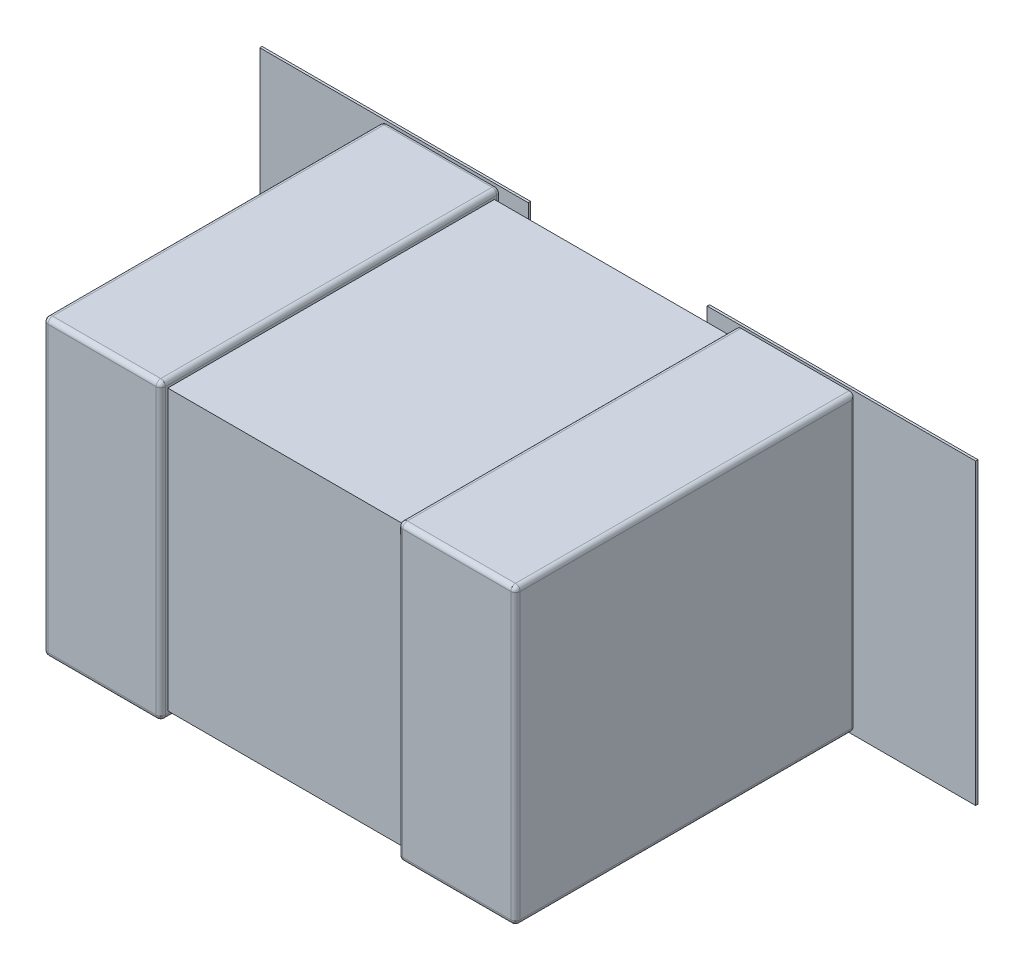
ISO-10303-21;
HEADER;
FILE_DESCRIPTION(('STEP AP214'),'2;1');
FILE_NAME('part.step','',(''),(''),'','','');
FILE_SCHEMA(('AUTOMOTIVE_DESIGN { 1 0 10303 214 1 1 1 1 }'));
ENDSEC;
DATA;
#1=APPLICATION_CONTEXT('core data for automotive mechanical design processes');
#2=APPLICATION_PROTOCOL_DEFINITION('international standard','automotive_design',2000,#1);
#3=PRODUCT_CONTEXT('',#1,'mechanical');
#4=PRODUCT('Part','Part','',(#3));
#5=PRODUCT_RELATED_PRODUCT_CATEGORY('part','',(#4));
#6=PRODUCT_DEFINITION_FORMATION('','',#4);
#7=PRODUCT_DEFINITION_CONTEXT('part definition',#1,'design');
#8=PRODUCT_DEFINITION('design','',#6,#7);
#9=PRODUCT_DEFINITION_SHAPE('','',#8);
#10=(LENGTH_UNIT() NAMED_UNIT(*) SI_UNIT(.MILLI.,.METRE.));
#11=(NAMED_UNIT(*) PLANE_ANGLE_UNIT() SI_UNIT($,.RADIAN.));
#12=(NAMED_UNIT(*) SI_UNIT($,.STERADIAN.) SOLID_ANGLE_UNIT());
#13=UNCERTAINTY_MEASURE_WITH_UNIT(LENGTH_MEASURE(1.E-05),#10,'distance_accuracy_value','');
#14=(GEOMETRIC_REPRESENTATION_CONTEXT(3) GLOBAL_UNCERTAINTY_ASSIGNED_CONTEXT((#13)) GLOBAL_UNIT_ASSIGNED_CONTEXT((#10,
#11,#12)) REPRESENTATION_CONTEXT('',''));
#15=CARTESIAN_POINT('',(0.,0.,0.));
#16=DIRECTION('',(0.,0.,1.));
#17=DIRECTION('',(1.,0.,0.));
#18=AXIS2_PLACEMENT_3D('',#15,#16,#17);
#19=CARTESIAN_POINT('',(0.,0.,0.0762));
#20=DIRECTION('',(0.,0.,1.));
#21=DIRECTION('',(1.,0.,0.));
#22=AXIS2_PLACEMENT_3D('',#19,#20,#21);
#23=PLANE('',#22);
#24=DIRECTION('',(1.,0.,0.));
#25=VECTOR('',#24,1.);
#26=CARTESIAN_POINT('',(-1.5235,-0.635,0.0762));
#27=LINE('',#26,#25);
#28=CARTESIAN_POINT('',(-1.5235,-0.635,0.0762));
#29=VERTEX_POINT('',#28);
#30=CARTESIAN_POINT('',(-0.380500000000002,-0.635,0.0762));
#31=VERTEX_POINT('',#30);
#32=EDGE_CURVE('E917',#29,#31,#27,.T.);
#33=ORIENTED_EDGE('',*,*,#32,.F.);
#34=DIRECTION('',(0.,1.,0.));
#35=VECTOR('',#34,1.);
#36=CARTESIAN_POINT('',(-1.5235,0.635,0.0762));
#37=LINE('',#36,#35);
#38=CARTESIAN_POINT('',(-1.5235,0.635,0.0762));
#39=VERTEX_POINT('',#38);
#40=EDGE_CURVE('E86',#39,#29,#37,.F.);
#41=ORIENTED_EDGE('',*,*,#40,.F.);
#42=DIRECTION('',(1.,0.,0.));
#43=VECTOR('',#42,1.);
#44=CARTESIAN_POINT('',(-0.380500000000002,0.635,0.0762));
#45=LINE('',#44,#43);
#46=CARTESIAN_POINT('',(-0.380500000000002,0.635,0.0762));
#47=VERTEX_POINT('',#46);
#48=EDGE_CURVE('E415',#47,#39,#45,.F.);
#49=ORIENTED_EDGE('',*,*,#48,.F.);
#50=DIRECTION('',(0.,1.,0.));
#51=VECTOR('',#50,1.);
#52=CARTESIAN_POINT('',(-0.380500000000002,-0.635,0.0762));
#53=LINE('',#52,#51);
#54=EDGE_CURVE('E924',#31,#47,#53,.T.);
#55=ORIENTED_EDGE('',*,*,#54,.F.);
#56=EDGE_LOOP('',(#33,#41,#49,#55));
#57=FACE_BOUND('',#56,.T.);
#58=ADVANCED_FACE('F16',(#57),#23,.F.);
#59=CARTESIAN_POINT('',(-0.98495100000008,0.60496700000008,1.50628600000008));
#60=DIRECTION('',(-0.707106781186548,0.,0.707106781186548));
#61=DIRECTION('',(0.,1.,0.));
#62=AXIS2_PLACEMENT_3D('',#59,#60,#61);
#63=SPHERICAL_SURFACE('',#62,0.0199999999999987);
#64=CARTESIAN_POINT('',(-0.98495100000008,0.60496700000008,1.50628600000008));
#65=DIRECTION('',(0.,-1.,0.));
#66=DIRECTION('',(0.,0.,-1.));
#67=AXIS2_PLACEMENT_3D('',#64,#65,#66);
#68=CIRCLE('',#67,0.0199999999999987);
#69=CARTESIAN_POINT('',(-0.98495100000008,0.60496700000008,1.52628600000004));
#70=VERTEX_POINT('',#69);
#71=CARTESIAN_POINT('',(-0.99909313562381,0.60496700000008,1.52042813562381));
#72=VERTEX_POINT('',#71);
#73=EDGE_CURVE('E248',#70,#72,#68,.T.);
#74=ORIENTED_EDGE('',*,*,#73,.F.);
#75=CARTESIAN_POINT('',(-0.98495100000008,0.60496700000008,1.50628600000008));
#76=DIRECTION('',(-1.,0.,0.));
#77=DIRECTION('',(0.,0.,1.));
#78=AXIS2_PLACEMENT_3D('',#75,#76,#77);
#79=CIRCLE('',#78,0.0199999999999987);
#80=CARTESIAN_POINT('',(-0.98495100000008,0.624967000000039,1.50628600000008));
#81=VERTEX_POINT('',#80);
#82=EDGE_CURVE('E251',#81,#70,#79,.F.);
#83=ORIENTED_EDGE('',*,*,#82,.F.);
#84=CARTESIAN_POINT('',(-0.98495100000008,0.60496700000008,1.50628600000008));
#85=DIRECTION('',(0.,0.,-1.));
#86=DIRECTION('',(-1.,0.,0.));
#87=AXIS2_PLACEMENT_3D('',#84,#85,#86);
#88=CIRCLE('',#87,0.0199999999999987);
#89=CARTESIAN_POINT('',(-1.00495100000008,0.60496700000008,1.50628600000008));
#90=VERTEX_POINT('',#89);
#91=EDGE_CURVE('E19',#90,#81,#88,.T.);
#92=ORIENTED_EDGE('',*,*,#91,.F.);
#93=CARTESIAN_POINT('',(-0.98495100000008,0.60496700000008,1.50628600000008));
#94=DIRECTION('',(0.,-1.,0.));
#95=DIRECTION('',(0.,0.,-1.));
#96=AXIS2_PLACEMENT_3D('',#93,#94,#95);
#97=CIRCLE('',#96,0.0199999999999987);
#98=EDGE_CURVE('E253',#72,#90,#97,.T.);
#99=ORIENTED_EDGE('',*,*,#98,.F.);
#100=EDGE_LOOP('',(#74,#83,#92,#99));
#101=FACE_BOUND('',#100,.T.);
#102=ADVANCED_FACE('F250',(#101),#63,.T.);
#103=CARTESIAN_POINT('',(-1.004951,0.624967,0.0762));
#104=DIRECTION('',(-1.,0.,0.));
#105=DIRECTION('',(0.,0.,1.));
#106=AXIS2_PLACEMENT_3D('',#103,#104,#105);
#107=PLANE('',#106);
#108=DIRECTION('',(0.,1.,0.));
#109=VECTOR('',#108,1.);
#110=CARTESIAN_POINT('',(-1.00495100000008,-2.43846719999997,0.0961999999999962));
#111=LINE('',#110,#109);
#112=CARTESIAN_POINT('',(-1.00495100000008,-0.60496700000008,0.0961999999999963));
#113=VERTEX_POINT('',#112);
#114=CARTESIAN_POINT('',(-1.00495100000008,0.60496700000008,0.0961999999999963));
#115=VERTEX_POINT('',#114);
#116=EDGE_CURVE('E414',#113,#115,#111,.T.);
#117=ORIENTED_EDGE('',*,*,#116,.F.);
#118=DIRECTION('',(0.,0.,-1.));
#119=VECTOR('',#118,1.);
#120=CARTESIAN_POINT('',(-1.00495100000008,-0.60496700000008,3.4166181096));
#121=LINE('',#120,#119);
#122=CARTESIAN_POINT('',(-1.00495100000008,-0.60496700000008,1.50628600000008));
#123=VERTEX_POINT('',#122);
#124=EDGE_CURVE('E457',#123,#113,#121,.T.);
#125=ORIENTED_EDGE('',*,*,#124,.F.);
#126=DIRECTION('',(0.,-1.,0.));
#127=VECTOR('',#126,1.);
#128=CARTESIAN_POINT('',(-1.00495100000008,2.43846719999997,1.50628600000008));
#129=LINE('',#128,#127);
#130=EDGE_CURVE('E453',#90,#123,#129,.T.);
#131=ORIENTED_EDGE('',*,*,#130,.F.);
#132=DIRECTION('',(0.,0.,-1.));
#133=VECTOR('',#132,1.);
#134=CARTESIAN_POINT('',(-1.00495100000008,0.60496700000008,3.4166181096));
#135=LINE('',#134,#133);
#136=EDGE_CURVE('E765',#115,#90,#135,.F.);
#137=ORIENTED_EDGE('',*,*,#136,.F.);
#138=EDGE_LOOP('',(#117,#125,#131,#137));
#139=FACE_BOUND('',#138,.T.);
#140=ADVANCED_FACE('F447',(#139),#107,.T.);
#141=CARTESIAN_POINT('',(-0.98495100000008,-0.60496700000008,1.50628600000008));
#142=DIRECTION('',(-0.707106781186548,-0.707106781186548,0.));
#143=DIRECTION('',(0.,0.,1.));
#144=AXIS2_PLACEMENT_3D('',#141,#142,#143);
#145=SPHERICAL_SURFACE('',#144,0.0199999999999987);
#146=CARTESIAN_POINT('',(-0.98495100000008,-0.60496700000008,1.50628600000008));
#147=DIRECTION('',(0.,0.,-1.));
#148=DIRECTION('',(-1.,0.,0.));
#149=AXIS2_PLACEMENT_3D('',#146,#147,#148);
#150=CIRCLE('',#149,0.0199999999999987);
#151=CARTESIAN_POINT('',(-0.99909313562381,-0.61910913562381,1.50628600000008));
#152=VERTEX_POINT('',#151);
#153=EDGE_CURVE('E34',#152,#123,#150,.T.);
#154=ORIENTED_EDGE('',*,*,#153,.F.);
#155=CARTESIAN_POINT('',(-0.98495100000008,-0.60496700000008,1.50628600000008));
#156=DIRECTION('',(0.,0.,-1.));
#157=DIRECTION('',(-1.,0.,0.));
#158=AXIS2_PLACEMENT_3D('',#155,#156,#157);
#159=CIRCLE('',#158,0.0199999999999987);
#160=CARTESIAN_POINT('',(-0.98495100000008,-0.624967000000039,1.50628600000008));
#161=VERTEX_POINT('',#160);
#162=EDGE_CURVE('E405',#161,#152,#159,.T.);
#163=ORIENTED_EDGE('',*,*,#162,.F.);
#164=CARTESIAN_POINT('',(-0.98495100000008,-0.60496700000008,1.50628600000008));
#165=DIRECTION('',(1.,0.,0.));
#166=DIRECTION('',(0.,0.,-1.));
#167=AXIS2_PLACEMENT_3D('',#164,#165,#166);
#168=CIRCLE('',#167,0.0199999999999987);
#169=CARTESIAN_POINT('',(-0.98495100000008,-0.60496700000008,1.52628600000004));
#170=VERTEX_POINT('',#169);
#171=EDGE_CURVE('E674',#170,#161,#168,.T.);
#172=ORIENTED_EDGE('',*,*,#171,.F.);
#173=CARTESIAN_POINT('',(-0.98495100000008,-0.60496700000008,1.50628600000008));
#174=DIRECTION('',(0.,-1.,0.));
#175=DIRECTION('',(0.,0.,-1.));
#176=AXIS2_PLACEMENT_3D('',#173,#174,#175);
#177=CIRCLE('',#176,0.0199999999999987);
#178=EDGE_CURVE('E271',#123,#170,#177,.F.);
#179=ORIENTED_EDGE('',*,*,#178,.F.);
#180=EDGE_LOOP('',(#154,#163,#172,#179));
#181=FACE_BOUND('',#180,.T.);
#182=ADVANCED_FACE('F442',(#181),#145,.T.);
#183=CARTESIAN_POINT('',(-0.98495100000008,0.60496700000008,3.4166181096));
#184=DIRECTION('',(0.,0.,-1.));
#185=DIRECTION('',(-1.,0.,0.));
#186=AXIS2_PLACEMENT_3D('',#183,#184,#185);
#187=CYLINDRICAL_SURFACE('',#186,0.0199999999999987);
#188=ORIENTED_EDGE('',*,*,#91,.T.);
#189=DIRECTION('',(0.,0.,1.));
#190=VECTOR('',#189,1.);
#191=CARTESIAN_POINT('',(-0.98495100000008,0.624967,0.0762));
#192=LINE('',#191,#190);
#193=CARTESIAN_POINT('',(-0.98495100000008,0.624967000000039,0.096199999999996));
#194=VERTEX_POINT('',#193);
#195=EDGE_CURVE('E451',#194,#81,#192,.T.);
#196=ORIENTED_EDGE('',*,*,#195,.F.);
#197=CARTESIAN_POINT('',(-0.98495100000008,0.60496700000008,0.0961999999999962));
#198=DIRECTION('',(0.,0.,-1.));
#199=DIRECTION('',(-0.707106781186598,0.707106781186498,0.));
#200=AXIS2_PLACEMENT_3D('',#197,#198,#199);
#201=CIRCLE('',#200,0.0199999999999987);
#202=CARTESIAN_POINT('',(-0.999093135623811,0.619109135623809,0.0961999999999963));
#203=VERTEX_POINT('',#202);
#204=EDGE_CURVE('E407',#203,#194,#201,.T.);
#205=ORIENTED_EDGE('',*,*,#204,.F.);
#206=CARTESIAN_POINT('',(-0.98495100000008,0.60496700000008,0.0961999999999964));
#207=DIRECTION('',(0.,0.,-1.));
#208=DIRECTION('',(-1.,0.,0.));
#209=AXIS2_PLACEMENT_3D('',#206,#207,#208);
#210=CIRCLE('',#209,0.0199999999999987);
#211=EDGE_CURVE('E410',#115,#203,#210,.T.);
#212=ORIENTED_EDGE('',*,*,#211,.F.);
#213=ORIENTED_EDGE('',*,*,#136,.T.);
#214=EDGE_LOOP('',(#188,#196,#205,#212,#213));
#215=FACE_BOUND('',#214,.T.);
#216=ADVANCED_FACE('F439',(#215),#187,.T.);
#217=CARTESIAN_POINT('',(-1.5235,0.635,0.0762));
#218=DIRECTION('',(-1.,0.,0.));
#219=DIRECTION('',(0.,0.,1.));
#220=AXIS2_PLACEMENT_3D('',#217,#218,#219);
#221=PLANE('',#220);
#222=DIRECTION('',(0.,0.,1.));
#223=VECTOR('',#222,1.);
#224=CARTESIAN_POINT('',(-1.5235,0.635,0.0762));
#225=LINE('',#224,#223);
#226=CARTESIAN_POINT('',(-1.5235,0.635,0.0862000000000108));
#227=VERTEX_POINT('',#226);
#228=EDGE_CURVE('E921',#39,#227,#225,.T.);
#229=ORIENTED_EDGE('',*,*,#228,.F.);
#230=ORIENTED_EDGE('',*,*,#40,.T.);
#231=DIRECTION('',(0.,0.,-1.));
#232=VECTOR('',#231,1.);
#233=CARTESIAN_POINT('',(-1.5235,-0.635,0.0762));
#234=LINE('',#233,#232);
#235=CARTESIAN_POINT('',(-1.5235,-0.635,0.0862000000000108));
#236=VERTEX_POINT('',#235);
#237=EDGE_CURVE('E919',#236,#29,#234,.T.);
#238=ORIENTED_EDGE('',*,*,#237,.F.);
#239=DIRECTION('',(0.,1.,0.));
#240=VECTOR('',#239,1.);
#241=CARTESIAN_POINT('',(-1.5235,0.,0.0862000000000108));
#242=LINE('',#241,#240);
#243=EDGE_CURVE('E350',#227,#236,#242,.F.);
#244=ORIENTED_EDGE('',*,*,#243,.F.);
#245=EDGE_LOOP('',(#229,#230,#238,#244));
#246=FACE_BOUND('',#245,.T.);
#247=ADVANCED_FACE('F435',(#246),#221,.T.);
#248=CARTESIAN_POINT('',(-1.5235,-0.635,0.0762));
#249=DIRECTION('',(0.,-1.,0.));
#250=DIRECTION('',(0.,0.,-1.));
#251=AXIS2_PLACEMENT_3D('',#248,#249,#250);
#252=PLANE('',#251);
#253=ORIENTED_EDGE('',*,*,#237,.T.);
#254=ORIENTED_EDGE('',*,*,#32,.T.);
#255=DIRECTION('',(0.,0.,-1.));
#256=VECTOR('',#255,1.);
#257=CARTESIAN_POINT('',(-0.380500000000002,-0.635,0.0762));
#258=LINE('',#257,#256);
#259=CARTESIAN_POINT('',(-0.380500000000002,-0.635,0.0862000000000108));
#260=VERTEX_POINT('',#259);
#261=EDGE_CURVE('E928',#260,#31,#258,.T.);
#262=ORIENTED_EDGE('',*,*,#261,.F.);
#263=DIRECTION('',(1.,0.,0.));
#264=VECTOR('',#263,1.);
#265=CARTESIAN_POINT('',(0.,-0.635,0.0862000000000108));
#266=LINE('',#265,#264);
#267=EDGE_CURVE('E347',#236,#260,#266,.T.);
#268=ORIENTED_EDGE('',*,*,#267,.F.);
#269=EDGE_LOOP('',(#253,#254,#262,#268));
#270=FACE_BOUND('',#269,.T.);
#271=ADVANCED_FACE('F431',(#270),#252,.T.);
#272=CARTESIAN_POINT('',(-0.380500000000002,-0.635,0.0762));
#273=DIRECTION('',(1.,0.,0.));
#274=DIRECTION('',(0.,0.,-1.));
#275=AXIS2_PLACEMENT_3D('',#272,#273,#274);
#276=PLANE('',#275);
#277=ORIENTED_EDGE('',*,*,#261,.T.);
#278=ORIENTED_EDGE('',*,*,#54,.T.);
#279=DIRECTION('',(0.,0.,1.));
#280=VECTOR('',#279,1.);
#281=CARTESIAN_POINT('',(-0.380500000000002,0.635,0.0762));
#282=LINE('',#281,#280);
#283=CARTESIAN_POINT('',(-0.380500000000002,0.635,0.0862000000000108));
#284=VERTEX_POINT('',#283);
#285=EDGE_CURVE('E923',#284,#47,#282,.F.);
#286=ORIENTED_EDGE('',*,*,#285,.F.);
#287=DIRECTION('',(0.,1.,0.));
#288=VECTOR('',#287,1.);
#289=CARTESIAN_POINT('',(-0.380500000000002,0.,0.0862000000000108));
#290=LINE('',#289,#288);
#291=EDGE_CURVE('E344',#260,#284,#290,.T.);
#292=ORIENTED_EDGE('',*,*,#291,.F.);
#293=EDGE_LOOP('',(#277,#278,#286,#292));
#294=FACE_BOUND('',#293,.T.);
#295=ADVANCED_FACE('F427',(#294),#276,.T.);
#296=CARTESIAN_POINT('',(-0.380500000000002,0.635,0.0762));
#297=DIRECTION('',(0.,1.,0.));
#298=DIRECTION('',(0.,0.,1.));
#299=AXIS2_PLACEMENT_3D('',#296,#297,#298);
#300=PLANE('',#299);
#301=ORIENTED_EDGE('',*,*,#285,.T.);
#302=ORIENTED_EDGE('',*,*,#48,.T.);
#303=ORIENTED_EDGE('',*,*,#228,.T.);
#304=DIRECTION('',(1.,0.,0.));
#305=VECTOR('',#304,1.);
#306=CARTESIAN_POINT('',(0.,0.635,0.0862000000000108));
#307=LINE('',#306,#305);
#308=EDGE_CURVE('E341',#284,#227,#307,.F.);
#309=ORIENTED_EDGE('',*,*,#308,.F.);
#310=EDGE_LOOP('',(#301,#302,#303,#309));
#311=FACE_BOUND('',#310,.T.);
#312=ADVANCED_FACE('F423',(#311),#300,.T.);
#313=CARTESIAN_POINT('',(-0.98495100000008,-0.60496700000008,0.0961999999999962));
#314=DIRECTION('',(-0.707106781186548,0.,-0.707106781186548));
#315=DIRECTION('',(0.,-1.,0.));
#316=AXIS2_PLACEMENT_3D('',#313,#314,#315);
#317=SPHERICAL_SURFACE('',#316,0.0199999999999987);
#318=CARTESIAN_POINT('',(-0.98495100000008,-0.60496700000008,0.0961999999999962));
#319=DIRECTION('',(0.,1.,0.));
#320=DIRECTION('',(0.,0.,1.));
#321=AXIS2_PLACEMENT_3D('',#318,#319,#320);
#322=CIRCLE('',#321,0.0199999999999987);
#323=CARTESIAN_POINT('',(-1.00227150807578,-0.60496700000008,0.0862000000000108));
#324=VERTEX_POINT('',#323);
#325=EDGE_CURVE('E411',#324,#113,#322,.T.);
#326=ORIENTED_EDGE('',*,*,#325,.F.);
#327=CARTESIAN_POINT('',(-0.98495100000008,-0.622287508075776,0.0862000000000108));
#328=CARTESIAN_POINT('',(-0.986903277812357,-0.622300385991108,0.0862000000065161));
#329=CARTESIAN_POINT('',(-0.988847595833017,-0.621959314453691,0.0862000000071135));
#330=CARTESIAN_POINT('',(-0.992520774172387,-0.620662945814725,0.0862000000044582));
#331=CARTESIAN_POINT('',(-0.994249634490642,-0.619707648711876,0.0862000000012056));
#332=CARTESIAN_POINT('',(-0.997292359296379,-0.617276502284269,0.086199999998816));
#333=CARTESIAN_POINT('',(-0.998606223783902,-0.615800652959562,0.0861999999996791));
#334=CARTESIAN_POINT('',(-1.00066964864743,-0.612495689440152,0.0862000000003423));
#335=CARTESIAN_POINT('',(-1.00141920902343,-0.610666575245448,0.0862000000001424));
#336=CARTESIAN_POINT('',(-1.00213177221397,-0.607521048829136,0.0861999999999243));
#337=CARTESIAN_POINT('',(-1.00227616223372,-0.606243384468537,0.0861999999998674));
#338=CARTESIAN_POINT('',(-1.00227150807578,-0.60496700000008,0.0862000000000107));
#339=B_SPLINE_CURVE_WITH_KNOTS('',3,(#327,#328,#329,#330,#331,#332,#333,#334,#335,#336,#337,
#338),.UNSPECIFIED.,.F.,.F.,(4,2,2,2,2,4),(0.,0.00581573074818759,0.0116314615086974,
0.0174471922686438,0.0232629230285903,0.0270884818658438),.UNSPECIFIED.);
#340=CARTESIAN_POINT('',(-0.98495100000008,-0.62228750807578,0.0862000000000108));
#341=VERTEX_POINT('',#340);
#342=EDGE_CURVE('E337',#341,#324,#339,.T.);
#343=ORIENTED_EDGE('',*,*,#342,.F.);
#344=CARTESIAN_POINT('',(-0.98495100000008,-0.60496700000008,0.0961999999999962));
#345=DIRECTION('',(-1.,0.,0.));
#346=DIRECTION('',(0.,0.,1.));
#347=AXIS2_PLACEMENT_3D('',#344,#345,#346);
#348=CIRCLE('',#347,0.0199999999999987);
#349=CARTESIAN_POINT('',(-0.98495100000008,-0.624967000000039,0.0961999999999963));
#350=VERTEX_POINT('',#349);
#351=EDGE_CURVE('E264',#350,#341,#348,.F.);
#352=ORIENTED_EDGE('',*,*,#351,.F.);
#353=CARTESIAN_POINT('',(-0.98495100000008,-0.60496700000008,0.0961999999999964));
#354=DIRECTION('',(0.,0.,-1.));
#355=DIRECTION('',(-1.,0.,0.));
#356=AXIS2_PLACEMENT_3D('',#353,#354,#355);
#357=CIRCLE('',#356,0.0199999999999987);
#358=EDGE_CURVE('E745',#113,#350,#357,.F.);
#359=ORIENTED_EDGE('',*,*,#358,.F.);
#360=EDGE_LOOP('',(#326,#343,#352,#359));
#361=FACE_BOUND('',#360,.T.);
#362=ADVANCED_FACE('F419',(#361),#317,.T.);
#363=CARTESIAN_POINT('',(-0.98495100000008,-2.43846719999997,0.0961999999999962));
#364=DIRECTION('',(0.,1.,0.));
#365=DIRECTION('',(0.,0.,1.));
#366=AXIS2_PLACEMENT_3D('',#363,#364,#365);
#367=CYLINDRICAL_SURFACE('',#366,0.0199999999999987);
#368=CARTESIAN_POINT('',(-0.98495100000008,0.60496700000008,0.0961999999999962));
#369=DIRECTION('',(0.,1.,0.));
#370=DIRECTION('',(0.,0.,1.));
#371=AXIS2_PLACEMENT_3D('',#368,#369,#370);
#372=CIRCLE('',#371,0.0199999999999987);
#373=CARTESIAN_POINT('',(-1.00227150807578,0.60496700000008,0.0862000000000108));
#374=VERTEX_POINT('',#373);
#375=EDGE_CURVE('E757',#374,#115,#372,.T.);
#376=ORIENTED_EDGE('',*,*,#375,.F.);
#377=DIRECTION('',(0.,1.,0.));
#378=VECTOR('',#377,1.);
#379=CARTESIAN_POINT('',(-1.00227150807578,0.,0.0862000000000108));
#380=LINE('',#379,#378);
#381=EDGE_CURVE('E334',#324,#374,#380,.T.);
#382=ORIENTED_EDGE('',*,*,#381,.F.);
#383=ORIENTED_EDGE('',*,*,#325,.T.);
#384=ORIENTED_EDGE('',*,*,#116,.T.);
#385=EDGE_LOOP('',(#376,#382,#383,#384));
#386=FACE_BOUND('',#385,.T.);
#387=ADVANCED_FACE('F399',(#386),#367,.T.);
#388=CARTESIAN_POINT('',(-0.98495100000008,0.60496700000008,0.0961999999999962));
#389=DIRECTION('',(-0.707106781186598,0.707106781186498,0.));
#390=DIRECTION('',(0.,0.,-1.));
#391=AXIS2_PLACEMENT_3D('',#388,#389,#390);
#392=SPHERICAL_SURFACE('',#391,0.0199999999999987);
#393=CARTESIAN_POINT('',(-0.98495100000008,0.60496700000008,0.0961999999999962));
#394=DIRECTION('',(1.,0.,0.));
#395=DIRECTION('',(0.,0.,-1.));
#396=AXIS2_PLACEMENT_3D('',#393,#394,#395);
#397=CIRCLE('',#396,0.0199999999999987);
#398=CARTESIAN_POINT('',(-0.98495100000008,0.62228750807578,0.0862000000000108));
#399=VERTEX_POINT('',#398);
#400=EDGE_CURVE('E409',#399,#194,#397,.T.);
#401=ORIENTED_EDGE('',*,*,#400,.F.);
#402=CARTESIAN_POINT('',(-1.00227150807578,0.60496700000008,0.0862000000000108));
#403=CARTESIAN_POINT('',(-1.00228438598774,0.60691927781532,0.0862000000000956));
#404=CARTESIAN_POINT('',(-1.00194331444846,0.608863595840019,0.0862000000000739));
#405=CARTESIAN_POINT('',(-1.00064694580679,0.612536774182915,0.0862000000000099));
#406=CARTESIAN_POINT('',(-0.999691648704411,0.614265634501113,0.0861999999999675));
#407=CARTESIAN_POINT('',(-0.99726050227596,0.617308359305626,0.0862000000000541));
#408=CARTESIAN_POINT('',(-0.995784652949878,0.618622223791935,0.086200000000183));
#409=CARTESIAN_POINT('',(-0.992479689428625,0.620685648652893,0.0862000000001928));
#410=CARTESIAN_POINT('',(-0.990650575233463,0.621435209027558,0.0862000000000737));
#411=CARTESIAN_POINT('',(-0.987505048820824,0.622147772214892,0.0861999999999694));
#412=CARTESIAN_POINT('',(-0.986227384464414,0.622292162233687,0.0861999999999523));
#413=CARTESIAN_POINT('',(-0.98495100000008,0.622287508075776,0.0862000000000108));
#414=B_SPLINE_CURVE_WITH_KNOTS('',3,(#402,#403,#404,#405,#406,#407,#408,#409,#410,#411,#412,
#413),.UNSPECIFIED.,.F.,.F.,(4,2,2,2,2,4),(0.,0.00581573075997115,0.0116314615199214,
0.0174471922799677,0.0232629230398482,0.0270884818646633),.UNSPECIFIED.);
#415=EDGE_CURVE('E333',#374,#399,#414,.T.);
#416=ORIENTED_EDGE('',*,*,#415,.F.);
#417=ORIENTED_EDGE('',*,*,#375,.T.);
#418=ORIENTED_EDGE('',*,*,#211,.T.);
#419=ORIENTED_EDGE('',*,*,#204,.T.);
#420=EDGE_LOOP('',(#401,#416,#417,#418,#419));
#421=FACE_BOUND('',#420,.T.);
#422=ADVANCED_FACE('F392',(#421),#392,.T.);
#423=CARTESIAN_POINT('',(-5.4955692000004,0.60496700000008,0.0961999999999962));
#424=DIRECTION('',(1.,0.,0.));
#425=DIRECTION('',(0.,0.,-1.));
#426=AXIS2_PLACEMENT_3D('',#423,#424,#425);
#427=CYLINDRICAL_SURFACE('',#426,0.0199999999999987);
#428=CARTESIAN_POINT('',(-0.524950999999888,0.60496700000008,0.0961999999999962));
#429=DIRECTION('',(1.,0.,0.));
#430=DIRECTION('',(0.,0.,-1.));
#431=AXIS2_PLACEMENT_3D('',#428,#429,#430);
#432=CIRCLE('',#431,0.0199999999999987);
#433=CARTESIAN_POINT('',(-0.524950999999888,0.62228750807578,0.0862000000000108));
#434=VERTEX_POINT('',#433);
#435=CARTESIAN_POINT('',(-0.524950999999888,0.624967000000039,0.0961999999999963));
#436=VERTEX_POINT('',#435);
#437=EDGE_CURVE('E353',#434,#436,#432,.T.);
#438=ORIENTED_EDGE('',*,*,#437,.F.);
#439=DIRECTION('',(1.,0.,0.));
#440=VECTOR('',#439,1.);
#441=CARTESIAN_POINT('',(0.,0.622287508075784,0.0862000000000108));
#442=LINE('',#441,#440);
#443=EDGE_CURVE('E329',#399,#434,#442,.T.);
#444=ORIENTED_EDGE('',*,*,#443,.F.);
#445=ORIENTED_EDGE('',*,*,#400,.T.);
#446=DIRECTION('',(1.,0.,0.));
#447=VECTOR('',#446,1.);
#448=CARTESIAN_POINT('',(1.004951,0.624967,0.0961999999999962));
#449=LINE('',#448,#447);
#450=EDGE_CURVE('E673',#436,#194,#449,.F.);
#451=ORIENTED_EDGE('',*,*,#450,.F.);
#452=EDGE_LOOP('',(#438,#444,#445,#451));
#453=FACE_BOUND('',#452,.T.);
#454=ADVANCED_FACE('F398',(#453),#427,.T.);
#455=CARTESIAN_POINT('',(-0.98495100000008,-0.60496700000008,3.4166181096));
#456=DIRECTION('',(0.,0.,-1.));
#457=DIRECTION('',(-1.,0.,0.));
#458=AXIS2_PLACEMENT_3D('',#455,#456,#457);
#459=CYLINDRICAL_SURFACE('',#458,0.0199999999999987);
#460=ORIENTED_EDGE('',*,*,#153,.T.);
#461=ORIENTED_EDGE('',*,*,#124,.T.);
#462=ORIENTED_EDGE('',*,*,#358,.T.);
#463=DIRECTION('',(0.,0.,-1.));
#464=VECTOR('',#463,1.);
#465=CARTESIAN_POINT('',(-0.98495100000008,-0.624967,0.0762));
#466=LINE('',#465,#464);
#467=EDGE_CURVE('E323',#161,#350,#466,.T.);
#468=ORIENTED_EDGE('',*,*,#467,.F.);
#469=ORIENTED_EDGE('',*,*,#162,.T.);
#470=EDGE_LOOP('',(#460,#461,#462,#468,#469));
#471=FACE_BOUND('',#470,.T.);
#472=ADVANCED_FACE('F742',(#471),#459,.T.);
#473=CARTESIAN_POINT('',(5.4955692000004,-0.60496700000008,0.0961999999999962));
#474=DIRECTION('',(-1.,0.,0.));
#475=DIRECTION('',(0.,0.,1.));
#476=AXIS2_PLACEMENT_3D('',#473,#474,#475);
#477=CYLINDRICAL_SURFACE('',#476,0.0199999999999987);
#478=ORIENTED_EDGE('',*,*,#351,.T.);
#479=DIRECTION('',(1.,0.,0.));
#480=VECTOR('',#479,1.);
#481=CARTESIAN_POINT('',(0.,-0.622287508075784,0.0862000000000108));
#482=LINE('',#481,#480);
#483=CARTESIAN_POINT('',(-0.524950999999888,-0.62228750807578,0.0862000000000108));
#484=VERTEX_POINT('',#483);
#485=EDGE_CURVE('E338',#484,#341,#482,.F.);
#486=ORIENTED_EDGE('',*,*,#485,.F.);
#487=CARTESIAN_POINT('',(-0.524950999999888,-0.60496700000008,0.0961999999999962));
#488=DIRECTION('',(-1.,0.,0.));
#489=DIRECTION('',(0.,0.,1.));
#490=AXIS2_PLACEMENT_3D('',#487,#488,#489);
#491=CIRCLE('',#490,0.0199999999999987);
#492=CARTESIAN_POINT('',(-0.524950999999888,-0.624967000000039,0.0961999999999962));
#493=VERTEX_POINT('',#492);
#494=EDGE_CURVE('E380',#493,#484,#491,.F.);
#495=ORIENTED_EDGE('',*,*,#494,.F.);
#496=DIRECTION('',(1.,0.,0.));
#497=VECTOR('',#496,1.);
#498=CARTESIAN_POINT('',(-1.004951,-0.624967,0.0961999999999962));
#499=LINE('',#498,#497);
#500=EDGE_CURVE('E320',#350,#493,#499,.T.);
#501=ORIENTED_EDGE('',*,*,#500,.F.);
#502=EDGE_LOOP('',(#478,#486,#495,#501));
#503=FACE_BOUND('',#502,.T.);
#504=ADVANCED_FACE('F697',(#503),#477,.T.);
#505=CARTESIAN_POINT('',(5.4955692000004,0.60496700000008,1.50628600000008));
#506=DIRECTION('',(-1.,0.,0.));
#507=DIRECTION('',(0.,0.,1.));
#508=AXIS2_PLACEMENT_3D('',#505,#506,#507);
#509=CYLINDRICAL_SURFACE('',#508,0.0199999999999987);
#510=ORIENTED_EDGE('',*,*,#82,.T.);
#511=DIRECTION('',(1.,0.,0.));
#512=VECTOR('',#511,1.);
#513=CARTESIAN_POINT('',(0.,0.60496700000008,1.526286));
#514=LINE('',#513,#512);
#515=CARTESIAN_POINT('',(-0.524950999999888,0.60496700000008,1.52628600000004));
#516=VERTEX_POINT('',#515);
#517=EDGE_CURVE('E260',#516,#70,#514,.F.);
#518=ORIENTED_EDGE('',*,*,#517,.F.);
#519=CARTESIAN_POINT('',(-0.524950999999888,0.60496700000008,1.50628600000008));
#520=DIRECTION('',(-1.,0.,0.));
#521=DIRECTION('',(0.,0.,1.));
#522=AXIS2_PLACEMENT_3D('',#519,#520,#521);
#523=CIRCLE('',#522,0.0199999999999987);
#524=CARTESIAN_POINT('',(-0.524950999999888,0.624967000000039,1.50628600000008));
#525=VERTEX_POINT('',#524);
#526=EDGE_CURVE('E282',#525,#516,#523,.F.);
#527=ORIENTED_EDGE('',*,*,#526,.F.);
#528=DIRECTION('',(1.,0.,0.));
#529=VECTOR('',#528,1.);
#530=CARTESIAN_POINT('',(1.004951,0.624967,1.50628600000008));
#531=LINE('',#530,#529);
#532=EDGE_CURVE('E263',#81,#525,#531,.T.);
#533=ORIENTED_EDGE('',*,*,#532,.F.);
#534=EDGE_LOOP('',(#510,#518,#527,#533));
#535=FACE_BOUND('',#534,.T.);
#536=ADVANCED_FACE('F258',(#535),#509,.T.);
#537=CARTESIAN_POINT('',(-0.98495100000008,2.43846719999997,1.50628600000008));
#538=DIRECTION('',(0.,-1.,0.));
#539=DIRECTION('',(0.,0.,-1.));
#540=AXIS2_PLACEMENT_3D('',#537,#538,#539);
#541=CYLINDRICAL_SURFACE('',#540,0.0199999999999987);
#542=ORIENTED_EDGE('',*,*,#178,.T.);
#543=DIRECTION('',(0.,1.,0.));
#544=VECTOR('',#543,1.);
#545=CARTESIAN_POINT('',(-0.98495100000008,0.,1.526286));
#546=LINE('',#545,#544);
#547=EDGE_CURVE('E268',#70,#170,#546,.F.);
#548=ORIENTED_EDGE('',*,*,#547,.F.);
#549=ORIENTED_EDGE('',*,*,#73,.T.);
#550=ORIENTED_EDGE('',*,*,#98,.T.);
#551=ORIENTED_EDGE('',*,*,#130,.T.);
#552=EDGE_LOOP('',(#542,#548,#549,#550,#551));
#553=FACE_BOUND('',#552,.T.);
#554=ADVANCED_FACE('F269',(#553),#541,.T.);
#555=CARTESIAN_POINT('',(-5.4955692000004,-0.60496700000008,1.50628600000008));
#556=DIRECTION('',(1.,0.,0.));
#557=DIRECTION('',(0.,0.,-1.));
#558=AXIS2_PLACEMENT_3D('',#555,#556,#557);
#559=CYLINDRICAL_SURFACE('',#558,0.0199999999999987);
#560=ORIENTED_EDGE('',*,*,#171,.T.);
#561=DIRECTION('',(1.,0.,0.));
#562=VECTOR('',#561,1.);
#563=CARTESIAN_POINT('',(-1.004951,-0.624967,1.50628600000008));
#564=LINE('',#563,#562);
#565=CARTESIAN_POINT('',(-0.524950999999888,-0.624967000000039,1.50628600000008));
#566=VERTEX_POINT('',#565);
#567=EDGE_CURVE('E318',#566,#161,#564,.F.);
#568=ORIENTED_EDGE('',*,*,#567,.F.);
#569=CARTESIAN_POINT('',(-0.524950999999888,-0.60496700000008,1.50628600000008));
#570=DIRECTION('',(1.,0.,0.));
#571=DIRECTION('',(0.,0.,-1.));
#572=AXIS2_PLACEMENT_3D('',#569,#570,#571);
#573=CIRCLE('',#572,0.0199999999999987);
#574=CARTESIAN_POINT('',(-0.524950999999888,-0.60496700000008,1.52628600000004));
#575=VERTEX_POINT('',#574);
#576=EDGE_CURVE('E284',#575,#566,#573,.T.);
#577=ORIENTED_EDGE('',*,*,#576,.F.);
#578=DIRECTION('',(1.,0.,0.));
#579=VECTOR('',#578,1.);
#580=CARTESIAN_POINT('',(0.,-0.60496700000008,1.526286));
#581=LINE('',#580,#579);
#582=EDGE_CURVE('E275',#170,#575,#581,.T.);
#583=ORIENTED_EDGE('',*,*,#582,.F.);
#584=EDGE_LOOP('',(#560,#568,#577,#583));
#585=FACE_BOUND('',#584,.T.);
#586=ADVANCED_FACE('F746',(#585),#559,.T.);
#587=CARTESIAN_POINT('',(1.004951,0.624967,0.0762));
#588=DIRECTION('',(0.,1.,0.));
#589=DIRECTION('',(0.,0.,1.));
#590=AXIS2_PLACEMENT_3D('',#587,#588,#589);
#591=PLANE('',#590);
#592=ORIENTED_EDGE('',*,*,#450,.T.);
#593=ORIENTED_EDGE('',*,*,#195,.T.);
#594=ORIENTED_EDGE('',*,*,#532,.T.);
#595=DIRECTION('',(0.,0.,-1.));
#596=VECTOR('',#595,1.);
#597=CARTESIAN_POINT('',(-0.524950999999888,0.624967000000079,3.4166181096));
#598=LINE('',#597,#596);
#599=EDGE_CURVE('E362',#436,#525,#598,.F.);
#600=ORIENTED_EDGE('',*,*,#599,.F.);
#601=EDGE_LOOP('',(#592,#593,#594,#600));
#602=FACE_BOUND('',#601,.T.);
#603=ADVANCED_FACE('F370',(#602),#591,.T.);
#604=CARTESIAN_POINT('',(-0.524950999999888,0.60496700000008,0.0961999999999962));
#605=DIRECTION('',(0.707106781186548,0.,-0.707106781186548));
#606=DIRECTION('',(0.,1.,0.));
#607=AXIS2_PLACEMENT_3D('',#604,#605,#606);
#608=SPHERICAL_SURFACE('',#607,0.0199999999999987);
#609=CARTESIAN_POINT('',(-0.524950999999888,0.60496700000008,0.0961999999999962));
#610=DIRECTION('',(0.,-1.,0.));
#611=DIRECTION('',(0.,0.,-1.));
#612=AXIS2_PLACEMENT_3D('',#609,#610,#611);
#613=CIRCLE('',#612,0.0199999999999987);
#614=CARTESIAN_POINT('',(-0.507630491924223,0.60496700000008,0.0861999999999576));
#615=VERTEX_POINT('',#614);
#616=CARTESIAN_POINT('',(-0.504950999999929,0.60496700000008,0.0961999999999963));
#617=VERTEX_POINT('',#616);
#618=EDGE_CURVE('E359',#615,#617,#613,.T.);
#619=ORIENTED_EDGE('',*,*,#618,.F.);
#620=CARTESIAN_POINT('',(-0.524950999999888,0.622287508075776,0.0862000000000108));
#621=CARTESIAN_POINT('',(-0.522998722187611,0.622300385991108,0.0862000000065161));
#622=CARTESIAN_POINT('',(-0.521054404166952,0.621959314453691,0.0862000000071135));
#623=CARTESIAN_POINT('',(-0.517381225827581,0.620662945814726,0.0862000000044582));
#624=CARTESIAN_POINT('',(-0.515652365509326,0.619707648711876,0.0862000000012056));
#625=CARTESIAN_POINT('',(-0.512609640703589,0.617276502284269,0.086199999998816));
#626=CARTESIAN_POINT('',(-0.511295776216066,0.615800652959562,0.0861999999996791));
#627=CARTESIAN_POINT('',(-0.509232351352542,0.612495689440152,0.0862000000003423));
#628=CARTESIAN_POINT('',(-0.508482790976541,0.610666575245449,0.0862000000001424));
#629=CARTESIAN_POINT('',(-0.507770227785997,0.607521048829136,0.0861999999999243));
#630=CARTESIAN_POINT('',(-0.507625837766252,0.606243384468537,0.0861999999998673));
#631=CARTESIAN_POINT('',(-0.507630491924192,0.60496700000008,0.0862000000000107));
#632=B_SPLINE_CURVE_WITH_KNOTS('',3,(#620,#621,#622,#623,#624,#625,#626,#627,#628,#629,#630,
#631),.UNSPECIFIED.,.F.,.F.,(4,2,2,2,2,4),(0.,0.00581573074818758,0.0116314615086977,
0.0174471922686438,0.0232629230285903,0.027088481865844),.UNSPECIFIED.);
#633=EDGE_CURVE('E332',#434,#615,#632,.T.);
#634=ORIENTED_EDGE('',*,*,#633,.F.);
#635=ORIENTED_EDGE('',*,*,#437,.T.);
#636=CARTESIAN_POINT('',(-0.524950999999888,0.60496700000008,0.0961999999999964));
#637=DIRECTION('',(0.,0.,-1.));
#638=DIRECTION('',(-1.,0.,0.));
#639=AXIS2_PLACEMENT_3D('',#636,#637,#638);
#640=CIRCLE('',#639,0.0199999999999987);
#641=EDGE_CURVE('E677',#617,#436,#640,.F.);
#642=ORIENTED_EDGE('',*,*,#641,.F.);
#643=EDGE_LOOP('',(#619,#634,#635,#642));
#644=FACE_BOUND('',#643,.T.);
#645=ADVANCED_FACE('F366',(#644),#608,.T.);
#646=CARTESIAN_POINT('',(0.,0.,0.0862000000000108));
#647=DIRECTION('',(0.,0.,1.));
#648=DIRECTION('',(1.,0.,0.));
#649=AXIS2_PLACEMENT_3D('',#646,#647,#648);
#650=PLANE('',#649);
#651=ORIENTED_EDGE('',*,*,#633,.T.);
#652=DIRECTION('',(0.,-1.,0.));
#653=VECTOR('',#652,1.);
#654=CARTESIAN_POINT('',(-0.507630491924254,2.43846719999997,0.0861999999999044));
#655=LINE('',#654,#653);
#656=CARTESIAN_POINT('',(-0.507630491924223,-0.60496700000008,0.0861999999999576));
#657=VERTEX_POINT('',#656);
#658=EDGE_CURVE('E354',#657,#615,#655,.F.);
#659=ORIENTED_EDGE('',*,*,#658,.F.);
#660=CARTESIAN_POINT('',(-0.524950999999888,-0.622287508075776,0.0862000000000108));
#661=CARTESIAN_POINT('',(-0.522998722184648,-0.622300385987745,0.08620000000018));
#662=CARTESIAN_POINT('',(-0.521054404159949,-0.621959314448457,0.0862000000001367));
#663=CARTESIAN_POINT('',(-0.517381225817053,-0.620662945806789,0.0862000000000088));
#664=CARTESIAN_POINT('',(-0.515652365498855,-0.619707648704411,0.0861999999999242));
#665=CARTESIAN_POINT('',(-0.512609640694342,-0.61727650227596,0.0862000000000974));
#666=CARTESIAN_POINT('',(-0.511295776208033,-0.615800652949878,0.0862000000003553));
#667=CARTESIAN_POINT('',(-0.509232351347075,-0.612495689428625,0.0862000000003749));
#668=CARTESIAN_POINT('',(-0.50848279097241,-0.610666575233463,0.0862000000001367));
#669=CARTESIAN_POINT('',(-0.507770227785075,-0.607521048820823,0.086199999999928));
#670=CARTESIAN_POINT('',(-0.507625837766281,-0.606243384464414,0.0861999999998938));
#671=CARTESIAN_POINT('',(-0.507630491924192,-0.60496700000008,0.0862000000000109));
#672=B_SPLINE_CURVE_WITH_KNOTS('',3,(#660,#661,#662,#663,#664,#665,#666,#667,#668,#669,#670,
#671),.UNSPECIFIED.,.F.,.F.,(4,2,2,2,2,4),(0.,0.00581573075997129,0.0116314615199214,
0.0174471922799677,0.0232629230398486,0.0270884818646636),.UNSPECIFIED.);
#673=EDGE_CURVE('E684',#484,#657,#672,.T.);
#674=ORIENTED_EDGE('',*,*,#673,.F.);
#675=ORIENTED_EDGE('',*,*,#485,.T.);
#676=ORIENTED_EDGE('',*,*,#342,.T.);
#677=ORIENTED_EDGE('',*,*,#381,.T.);
#678=ORIENTED_EDGE('',*,*,#415,.T.);
#679=ORIENTED_EDGE('',*,*,#443,.T.);
#680=EDGE_LOOP('',(#651,#659,#674,#675,#676,#677,#678,#679));
#681=FACE_BOUND('',#680,.T.);
#682=ORIENTED_EDGE('',*,*,#291,.T.);
#683=ORIENTED_EDGE('',*,*,#308,.T.);
#684=ORIENTED_EDGE('',*,*,#243,.T.);
#685=ORIENTED_EDGE('',*,*,#267,.T.);
#686=EDGE_LOOP('',(#682,#683,#684,#685));
#687=FACE_BOUND('',#686,.T.);
#688=ADVANCED_FACE('F310',(#681,#687),#650,.T.);
#689=CARTESIAN_POINT('',(-0.524950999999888,-0.60496700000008,0.0961999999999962));
#690=DIRECTION('',(0.707106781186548,-0.707106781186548,0.));
#691=DIRECTION('',(0.,0.,-1.));
#692=AXIS2_PLACEMENT_3D('',#689,#690,#691);
#693=SPHERICAL_SURFACE('',#692,0.0199999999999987);
#694=ORIENTED_EDGE('',*,*,#494,.T.);
#695=ORIENTED_EDGE('',*,*,#673,.T.);
#696=CARTESIAN_POINT('',(-0.524950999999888,-0.60496700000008,0.0961999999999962));
#697=DIRECTION('',(0.,-1.,0.));
#698=DIRECTION('',(0.,0.,-1.));
#699=AXIS2_PLACEMENT_3D('',#696,#697,#698);
#700=CIRCLE('',#699,0.0199999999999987);
#701=CARTESIAN_POINT('',(-0.504950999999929,-0.60496700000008,0.0961999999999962));
#702=VERTEX_POINT('',#701);
#703=EDGE_CURVE('E358',#702,#657,#700,.F.);
#704=ORIENTED_EDGE('',*,*,#703,.F.);
#705=CARTESIAN_POINT('',(-0.524950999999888,-0.60496700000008,0.0961999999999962));
#706=DIRECTION('',(0.,0.,1.));
#707=DIRECTION('',(1.,0.,0.));
#708=AXIS2_PLACEMENT_3D('',#705,#706,#707);
#709=CIRCLE('',#708,0.0199999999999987);
#710=CARTESIAN_POINT('',(-0.510808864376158,-0.61910913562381,0.0961999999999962));
#711=VERTEX_POINT('',#710);
#712=EDGE_CURVE('E706',#711,#702,#709,.T.);
#713=ORIENTED_EDGE('',*,*,#712,.F.);
#714=CARTESIAN_POINT('',(-0.524950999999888,-0.60496700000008,0.0961999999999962));
#715=DIRECTION('',(0.,0.,1.));
#716=DIRECTION('',(1.,0.,0.));
#717=AXIS2_PLACEMENT_3D('',#714,#715,#716);
#718=CIRCLE('',#717,0.0199999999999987);
#719=EDGE_CURVE('E357',#493,#711,#718,.T.);
#720=ORIENTED_EDGE('',*,*,#719,.F.);
#721=EDGE_LOOP('',(#694,#695,#704,#713,#720));
#722=FACE_BOUND('',#721,.T.);
#723=ADVANCED_FACE('F304',(#722),#693,.T.);
#724=CARTESIAN_POINT('',(-1.004951,-0.624967,0.0762));
#725=DIRECTION('',(0.,-1.,0.));
#726=DIRECTION('',(0.,0.,-1.));
#727=AXIS2_PLACEMENT_3D('',#724,#725,#726);
#728=PLANE('',#727);
#729=DIRECTION('',(0.,0.,1.));
#730=VECTOR('',#729,1.);
#731=CARTESIAN_POINT('',(-0.524950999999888,-0.624967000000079,-1.8141321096));
#732=LINE('',#731,#730);
#733=EDGE_CURVE('E713',#566,#493,#732,.F.);
#734=ORIENTED_EDGE('',*,*,#733,.F.);
#735=ORIENTED_EDGE('',*,*,#567,.T.);
#736=ORIENTED_EDGE('',*,*,#467,.T.);
#737=ORIENTED_EDGE('',*,*,#500,.T.);
#738=EDGE_LOOP('',(#734,#735,#736,#737));
#739=FACE_BOUND('',#738,.T.);
#740=ADVANCED_FACE('F298',(#739),#728,.T.);
#741=CARTESIAN_POINT('',(-0.524950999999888,-0.60496700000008,1.50628600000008));
#742=DIRECTION('',(0.707106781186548,0.,0.707106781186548));
#743=DIRECTION('',(0.,-1.,0.));
#744=AXIS2_PLACEMENT_3D('',#741,#742,#743);
#745=SPHERICAL_SURFACE('',#744,0.0199999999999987);
#746=CARTESIAN_POINT('',(-0.524950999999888,-0.60496700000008,1.50628600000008));
#747=DIRECTION('',(0.,1.,0.));
#748=DIRECTION('',(0.,0.,1.));
#749=AXIS2_PLACEMENT_3D('',#746,#747,#748);
#750=CIRCLE('',#749,0.0199999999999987);
#751=CARTESIAN_POINT('',(-0.510808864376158,-0.60496700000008,1.52042813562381));
#752=VERTEX_POINT('',#751);
#753=CARTESIAN_POINT('',(-0.504950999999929,-0.60496700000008,1.50628600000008));
#754=VERTEX_POINT('',#753);
#755=EDGE_CURVE('E726',#752,#754,#750,.T.);
#756=ORIENTED_EDGE('',*,*,#755,.F.);
#757=CARTESIAN_POINT('',(-0.524950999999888,-0.60496700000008,1.50628600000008));
#758=DIRECTION('',(0.,1.,0.));
#759=DIRECTION('',(0.,0.,1.));
#760=AXIS2_PLACEMENT_3D('',#757,#758,#759);
#761=CIRCLE('',#760,0.0199999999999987);
#762=EDGE_CURVE('E716',#575,#752,#761,.T.);
#763=ORIENTED_EDGE('',*,*,#762,.F.);
#764=ORIENTED_EDGE('',*,*,#576,.T.);
#765=CARTESIAN_POINT('',(-0.524950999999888,-0.60496700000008,1.50628600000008));
#766=DIRECTION('',(0.,0.,1.));
#767=DIRECTION('',(1.,0.,0.));
#768=AXIS2_PLACEMENT_3D('',#765,#766,#767);
#769=CIRCLE('',#768,0.0199999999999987);
#770=EDGE_CURVE('E709',#754,#566,#769,.F.);
#771=ORIENTED_EDGE('',*,*,#770,.F.);
#772=EDGE_LOOP('',(#756,#763,#764,#771));
#773=FACE_BOUND('',#772,.T.);
#774=ADVANCED_FACE('F293',(#773),#745,.T.);
#775=CARTESIAN_POINT('',(-0.524950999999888,0.60496700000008,1.50628600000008));
#776=DIRECTION('',(0.707106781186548,0.707106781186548,0.));
#777=DIRECTION('',(0.,0.,1.));
#778=AXIS2_PLACEMENT_3D('',#775,#776,#777);
#779=SPHERICAL_SURFACE('',#778,0.0199999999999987);
#780=CARTESIAN_POINT('',(-0.524950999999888,0.60496700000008,1.50628600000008));
#781=DIRECTION('',(0.,0.,-1.));
#782=DIRECTION('',(-1.,0.,0.));
#783=AXIS2_PLACEMENT_3D('',#780,#781,#782);
#784=CIRCLE('',#783,0.0199999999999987);
#785=CARTESIAN_POINT('',(-0.510808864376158,0.61910913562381,1.50628600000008));
#786=VERTEX_POINT('',#785);
#787=EDGE_CURVE('E662',#525,#786,#784,.T.);
#788=ORIENTED_EDGE('',*,*,#787,.F.);
#789=ORIENTED_EDGE('',*,*,#526,.T.);
#790=CARTESIAN_POINT('',(-0.524950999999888,0.60496700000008,1.50628600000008));
#791=DIRECTION('',(0.,1.,0.));
#792=DIRECTION('',(0.,0.,1.));
#793=AXIS2_PLACEMENT_3D('',#790,#791,#792);
#794=CIRCLE('',#793,0.0199999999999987);
#795=CARTESIAN_POINT('',(-0.504950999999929,0.60496700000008,1.50628600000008));
#796=VERTEX_POINT('',#795);
#797=EDGE_CURVE('E724',#796,#516,#794,.F.);
#798=ORIENTED_EDGE('',*,*,#797,.F.);
#799=CARTESIAN_POINT('',(-0.524950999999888,0.60496700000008,1.50628600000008));
#800=DIRECTION('',(0.,0.,-1.));
#801=DIRECTION('',(-1.,0.,0.));
#802=AXIS2_PLACEMENT_3D('',#799,#800,#801);
#803=CIRCLE('',#802,0.0199999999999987);
#804=EDGE_CURVE('E664',#786,#796,#803,.T.);
#805=ORIENTED_EDGE('',*,*,#804,.F.);
#806=EDGE_LOOP('',(#788,#789,#798,#805));
#807=FACE_BOUND('',#806,.T.);
#808=ADVANCED_FACE('F297',(#807),#779,.T.);
#809=CARTESIAN_POINT('',(0.,0.,1.526286));
#810=DIRECTION('',(0.,0.,1.));
#811=DIRECTION('',(1.,0.,0.));
#812=AXIS2_PLACEMENT_3D('',#809,#810,#811);
#813=PLANE('',#812);
#814=ORIENTED_EDGE('',*,*,#547,.T.);
#815=ORIENTED_EDGE('',*,*,#582,.T.);
#816=DIRECTION('',(0.,1.,0.));
#817=VECTOR('',#816,1.);
#818=CARTESIAN_POINT('',(-0.524950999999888,-2.43846719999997,1.52628600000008));
#819=LINE('',#818,#817);
#820=EDGE_CURVE('E280',#516,#575,#819,.F.);
#821=ORIENTED_EDGE('',*,*,#820,.F.);
#822=ORIENTED_EDGE('',*,*,#517,.T.);
#823=EDGE_LOOP('',(#814,#815,#821,#822));
#824=FACE_BOUND('',#823,.T.);
#825=ADVANCED_FACE('F278',(#824),#813,.T.);
#826=CARTESIAN_POINT('',(-0.524950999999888,0.60496700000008,3.4166181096));
#827=DIRECTION('',(0.,0.,-1.));
#828=DIRECTION('',(-1.,0.,0.));
#829=AXIS2_PLACEMENT_3D('',#826,#827,#828);
#830=CYLINDRICAL_SURFACE('',#829,0.0199999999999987);
#831=ORIENTED_EDGE('',*,*,#641,.T.);
#832=ORIENTED_EDGE('',*,*,#599,.T.);
#833=ORIENTED_EDGE('',*,*,#787,.T.);
#834=ORIENTED_EDGE('',*,*,#804,.T.);
#835=DIRECTION('',(0.,0.,1.));
#836=VECTOR('',#835,1.);
#837=CARTESIAN_POINT('',(-0.504950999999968,0.60496700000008,0.0762));
#838=LINE('',#837,#836);
#839=EDGE_CURVE('E328',#796,#617,#838,.F.);
#840=ORIENTED_EDGE('',*,*,#839,.T.);
#841=EDGE_LOOP('',(#831,#832,#833,#834,#840));
#842=FACE_BOUND('',#841,.T.);
#843=ADVANCED_FACE('F649',(#842),#830,.T.);
#844=CARTESIAN_POINT('',(-0.524950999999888,2.43846719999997,0.0961999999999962));
#845=DIRECTION('',(0.,-1.,0.));
#846=DIRECTION('',(0.,0.,-1.));
#847=AXIS2_PLACEMENT_3D('',#844,#845,#846);
#848=CYLINDRICAL_SURFACE('',#847,0.0199999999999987);
#849=ORIENTED_EDGE('',*,*,#703,.T.);
#850=ORIENTED_EDGE('',*,*,#658,.T.);
#851=ORIENTED_EDGE('',*,*,#618,.T.);
#852=DIRECTION('',(0.,1.,0.));
#853=VECTOR('',#852,1.);
#854=CARTESIAN_POINT('',(-0.504950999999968,-0.624967,0.0961999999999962));
#855=LINE('',#854,#853);
#856=EDGE_CURVE('E324',#617,#702,#855,.F.);
#857=ORIENTED_EDGE('',*,*,#856,.T.);
#858=EDGE_LOOP('',(#849,#850,#851,#857));
#859=FACE_BOUND('',#858,.T.);
#860=ADVANCED_FACE('F645',(#859),#848,.T.);
#861=CARTESIAN_POINT('',(-0.524950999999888,-0.60496700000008,-1.8141321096));
#862=DIRECTION('',(0.,0.,1.));
#863=DIRECTION('',(1.,0.,0.));
#864=AXIS2_PLACEMENT_3D('',#861,#862,#863);
#865=CYLINDRICAL_SURFACE('',#864,0.0199999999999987);
#866=ORIENTED_EDGE('',*,*,#770,.T.);
#867=ORIENTED_EDGE('',*,*,#733,.T.);
#868=ORIENTED_EDGE('',*,*,#719,.T.);
#869=ORIENTED_EDGE('',*,*,#712,.T.);
#870=DIRECTION('',(0.,0.,1.));
#871=VECTOR('',#870,1.);
#872=CARTESIAN_POINT('',(-0.504950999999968,-0.60496700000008,0.0762));
#873=LINE('',#872,#871);
#874=EDGE_CURVE('E327',#702,#754,#873,.T.);
#875=ORIENTED_EDGE('',*,*,#874,.T.);
#876=EDGE_LOOP('',(#866,#867,#868,#869,#875));
#877=FACE_BOUND('',#876,.T.);
#878=ADVANCED_FACE('F641',(#877),#865,.T.);
#879=CARTESIAN_POINT('',(-0.524950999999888,-2.43846719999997,1.50628600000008));
#880=DIRECTION('',(0.,1.,0.));
#881=DIRECTION('',(0.,0.,1.));
#882=AXIS2_PLACEMENT_3D('',#879,#880,#881);
#883=CYLINDRICAL_SURFACE('',#882,0.0199999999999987);
#884=ORIENTED_EDGE('',*,*,#797,.T.);
#885=ORIENTED_EDGE('',*,*,#820,.T.);
#886=ORIENTED_EDGE('',*,*,#762,.T.);
#887=ORIENTED_EDGE('',*,*,#755,.T.);
#888=DIRECTION('',(0.,1.,0.));
#889=VECTOR('',#888,1.);
#890=CARTESIAN_POINT('',(-0.504950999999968,-0.624967,1.50628600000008));
#891=LINE('',#890,#889);
#892=EDGE_CURVE('E720',#754,#796,#891,.T.);
#893=ORIENTED_EDGE('',*,*,#892,.T.);
#894=EDGE_LOOP('',(#884,#885,#886,#887,#893));
#895=FACE_BOUND('',#894,.T.);
#896=ADVANCED_FACE('F637',(#895),#883,.T.);
#897=CARTESIAN_POINT('',(-0.504950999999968,-0.624967,0.0762));
#898=DIRECTION('',(-1.,0.,0.));
#899=DIRECTION('',(0.,0.,1.));
#900=AXIS2_PLACEMENT_3D('',#897,#898,#899);
#901=PLANE('',#900);
#902=DIRECTION('',(0.,0.,-1.));
#903=VECTOR('',#902,1.);
#904=CARTESIAN_POINT('',(-0.504950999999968,0.59496700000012,0.0762));
#905=LINE('',#904,#903);
#906=CARTESIAN_POINT('',(-0.504950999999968,0.59496700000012,1.49628600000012));
#907=VERTEX_POINT('',#906);
#908=CARTESIAN_POINT('',(-0.504950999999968,0.59496700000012,0.106200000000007));
#909=VERTEX_POINT('',#908);
#910=EDGE_CURVE('E600',#907,#909,#905,.T.);
#911=ORIENTED_EDGE('',*,*,#910,.T.);
#912=DIRECTION('',(0.,1.,0.));
#913=VECTOR('',#912,1.);
#914=CARTESIAN_POINT('',(-0.504950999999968,-0.624967,0.106200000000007));
#915=LINE('',#914,#913);
#916=CARTESIAN_POINT('',(-0.504950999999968,-0.59496700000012,0.106200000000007));
#917=VERTEX_POINT('',#916);
#918=EDGE_CURVE('E722',#909,#917,#915,.F.);
#919=ORIENTED_EDGE('',*,*,#918,.T.);
#920=DIRECTION('',(0.,0.,1.));
#921=VECTOR('',#920,1.);
#922=CARTESIAN_POINT('',(-0.504950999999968,-0.59496700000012,1.526286));
#923=LINE('',#922,#921);
#924=CARTESIAN_POINT('',(-0.504950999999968,-0.59496700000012,1.49628600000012));
#925=VERTEX_POINT('',#924);
#926=EDGE_CURVE('E872',#917,#925,#923,.T.);
#927=ORIENTED_EDGE('',*,*,#926,.T.);
#928=DIRECTION('',(0.,1.,0.));
#929=VECTOR('',#928,1.);
#930=CARTESIAN_POINT('',(-0.504950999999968,0.624967,1.49628600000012));
#931=LINE('',#930,#929);
#932=EDGE_CURVE('E866',#925,#907,#931,.T.);
#933=ORIENTED_EDGE('',*,*,#932,.T.);
#934=EDGE_LOOP('',(#911,#919,#927,#933));
#935=FACE_BOUND('',#934,.T.);
#936=ORIENTED_EDGE('',*,*,#874,.F.);
#937=ORIENTED_EDGE('',*,*,#856,.F.);
#938=ORIENTED_EDGE('',*,*,#839,.F.);
#939=ORIENTED_EDGE('',*,*,#892,.F.);
#940=EDGE_LOOP('',(#936,#937,#938,#939));
#941=FACE_BOUND('',#940,.T.);
#942=ADVANCED_FACE('F633',(#935,#941),#901,.F.);
#943=CARTESIAN_POINT('',(-0.504950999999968,-0.624967,0.106200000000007));
#944=DIRECTION('',(0.,0.,1.));
#945=DIRECTION('',(1.,0.,0.));
#946=AXIS2_PLACEMENT_3D('',#943,#944,#945);
#947=PLANE('',#946);
#948=DIRECTION('',(1.,0.,0.));
#949=VECTOR('',#948,1.);
#950=CARTESIAN_POINT('',(-0.504950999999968,0.59496700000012,0.106200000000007));
#951=LINE('',#950,#949);
#952=CARTESIAN_POINT('',(0.504950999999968,0.59496700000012,0.106200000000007));
#953=VERTEX_POINT('',#952);
#954=EDGE_CURVE('E863',#909,#953,#951,.T.);
#955=ORIENTED_EDGE('',*,*,#954,.T.);
#956=DIRECTION('',(0.,1.,0.));
#957=VECTOR('',#956,1.);
#958=CARTESIAN_POINT('',(0.504950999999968,-0.624967,0.106200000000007));
#959=LINE('',#958,#957);
#960=CARTESIAN_POINT('',(0.504950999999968,-0.59496700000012,0.106200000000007));
#961=VERTEX_POINT('',#960);
#962=EDGE_CURVE('E597',#953,#961,#959,.F.);
#963=ORIENTED_EDGE('',*,*,#962,.T.);
#964=DIRECTION('',(1.,0.,0.));
#965=VECTOR('',#964,1.);
#966=CARTESIAN_POINT('',(-0.504950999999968,-0.59496700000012,0.106200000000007));
#967=LINE('',#966,#965);
#968=EDGE_CURVE('E875',#961,#917,#967,.F.);
#969=ORIENTED_EDGE('',*,*,#968,.T.);
#970=ORIENTED_EDGE('',*,*,#918,.F.);
#971=EDGE_LOOP('',(#955,#963,#969,#970));
#972=FACE_BOUND('',#971,.T.);
#973=ADVANCED_FACE('F629',(#972),#947,.F.);
#974=CARTESIAN_POINT('',(-0.504950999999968,-0.59496700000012,1.526286));
#975=DIRECTION('',(0.,1.,0.));
#976=DIRECTION('',(0.,0.,1.));
#977=AXIS2_PLACEMENT_3D('',#974,#975,#976);
#978=PLANE('',#977);
#979=ORIENTED_EDGE('',*,*,#968,.F.);
#980=DIRECTION('',(0.,0.,-1.));
#981=VECTOR('',#980,1.);
#982=CARTESIAN_POINT('',(0.504950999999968,-0.59496700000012,0.106200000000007));
#983=LINE('',#982,#981);
#984=CARTESIAN_POINT('',(0.504950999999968,-0.59496700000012,1.49628600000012));
#985=VERTEX_POINT('',#984);
#986=EDGE_CURVE('E594',#961,#985,#983,.F.);
#987=ORIENTED_EDGE('',*,*,#986,.T.);
#988=DIRECTION('',(-1.,0.,0.));
#989=VECTOR('',#988,1.);
#990=CARTESIAN_POINT('',(-0.504950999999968,-0.59496700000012,1.49628600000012));
#991=LINE('',#990,#989);
#992=EDGE_CURVE('E869',#985,#925,#991,.T.);
#993=ORIENTED_EDGE('',*,*,#992,.T.);
#994=ORIENTED_EDGE('',*,*,#926,.F.);
#995=EDGE_LOOP('',(#979,#987,#993,#994));
#996=FACE_BOUND('',#995,.T.);
#997=ADVANCED_FACE('F625',(#996),#978,.F.);
#998=CARTESIAN_POINT('',(-0.504950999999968,0.624967,1.49628600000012));
#999=DIRECTION('',(0.,0.,-1.));
#1000=DIRECTION('',(-1.,0.,0.));
#1001=AXIS2_PLACEMENT_3D('',#998,#999,#1000);
#1002=PLANE('',#1001);
#1003=ORIENTED_EDGE('',*,*,#992,.F.);
#1004=DIRECTION('',(0.,1.,0.));
#1005=VECTOR('',#1004,1.);
#1006=CARTESIAN_POINT('',(0.504950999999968,-0.624967,1.49628600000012));
#1007=LINE('',#1006,#1005);
#1008=CARTESIAN_POINT('',(0.504950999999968,0.59496700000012,1.49628600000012));
#1009=VERTEX_POINT('',#1008);
#1010=EDGE_CURVE('E591',#985,#1009,#1007,.T.);
#1011=ORIENTED_EDGE('',*,*,#1010,.T.);
#1012=DIRECTION('',(1.,0.,0.));
#1013=VECTOR('',#1012,1.);
#1014=CARTESIAN_POINT('',(-0.504950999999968,0.59496700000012,1.49628600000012));
#1015=LINE('',#1014,#1013);
#1016=EDGE_CURVE('E860',#1009,#907,#1015,.F.);
#1017=ORIENTED_EDGE('',*,*,#1016,.T.);
#1018=ORIENTED_EDGE('',*,*,#932,.F.);
#1019=EDGE_LOOP('',(#1003,#1011,#1017,#1018));
#1020=FACE_BOUND('',#1019,.T.);
#1021=ADVANCED_FACE('F621',(#1020),#1002,.F.);
#1022=CARTESIAN_POINT('',(-0.504950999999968,0.59496700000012,0.0762));
#1023=DIRECTION('',(0.,-1.,0.));
#1024=DIRECTION('',(0.,0.,-1.));
#1025=AXIS2_PLACEMENT_3D('',#1022,#1023,#1024);
#1026=PLANE('',#1025);
#1027=ORIENTED_EDGE('',*,*,#1016,.F.);
#1028=DIRECTION('',(0.,0.,-1.));
#1029=VECTOR('',#1028,1.);
#1030=CARTESIAN_POINT('',(0.504950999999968,0.59496700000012,0.106200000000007));
#1031=LINE('',#1030,#1029);
#1032=EDGE_CURVE('E580',#1009,#953,#1031,.T.);
#1033=ORIENTED_EDGE('',*,*,#1032,.T.);
#1034=ORIENTED_EDGE('',*,*,#954,.F.);
#1035=ORIENTED_EDGE('',*,*,#910,.F.);
#1036=EDGE_LOOP('',(#1027,#1033,#1034,#1035));
#1037=FACE_BOUND('',#1036,.T.);
#1038=ADVANCED_FACE('F617',(#1037),#1026,.F.);
#1039=CARTESIAN_POINT('',(0.524950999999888,-0.60496700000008,1.50628600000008));
#1040=DIRECTION('',(-0.707106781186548,-0.707106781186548,0.));
#1041=DIRECTION('',(0.,0.,1.));
#1042=AXIS2_PLACEMENT_3D('',#1039,#1040,#1041);
#1043=SPHERICAL_SURFACE('',#1042,0.0199999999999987);
#1044=CARTESIAN_POINT('',(0.524950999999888,-0.60496700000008,1.50628600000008));
#1045=DIRECTION('',(1.,0.,0.));
#1046=DIRECTION('',(0.,0.,-1.));
#1047=AXIS2_PLACEMENT_3D('',#1044,#1045,#1046);
#1048=CIRCLE('',#1047,0.0199999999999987);
#1049=CARTESIAN_POINT('',(0.524950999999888,-0.60496700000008,1.52628600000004));
#1050=VERTEX_POINT('',#1049);
#1051=CARTESIAN_POINT('',(0.524950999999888,-0.624967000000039,1.50628600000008));
#1052=VERTEX_POINT('',#1051);
#1053=EDGE_CURVE('E570',#1050,#1052,#1048,.T.);
#1054=ORIENTED_EDGE('',*,*,#1053,.F.);
#1055=CARTESIAN_POINT('',(0.524950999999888,-0.60496700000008,1.50628600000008));
#1056=DIRECTION('',(0.,-1.,0.));
#1057=DIRECTION('',(0.,0.,-1.));
#1058=AXIS2_PLACEMENT_3D('',#1055,#1056,#1057);
#1059=CIRCLE('',#1058,0.0199999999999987);
#1060=CARTESIAN_POINT('',(0.504950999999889,-0.60496700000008,1.50628600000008));
#1061=VERTEX_POINT('',#1060);
#1062=EDGE_CURVE('E849',#1061,#1050,#1059,.F.);
#1063=ORIENTED_EDGE('',*,*,#1062,.F.);
#1064=CARTESIAN_POINT('',(0.524950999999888,-0.60496700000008,1.50628600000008));
#1065=DIRECTION('',(0.,0.,-1.));
#1066=DIRECTION('',(-1.,0.,0.));
#1067=AXIS2_PLACEMENT_3D('',#1064,#1065,#1066);
#1068=CIRCLE('',#1067,0.0199999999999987);
#1069=CARTESIAN_POINT('',(0.510808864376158,-0.61910913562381,1.50628600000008));
#1070=VERTEX_POINT('',#1069);
#1071=EDGE_CURVE('E569',#1070,#1061,#1068,.T.);
#1072=ORIENTED_EDGE('',*,*,#1071,.F.);
#1073=CARTESIAN_POINT('',(0.524950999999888,-0.60496700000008,1.50628600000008));
#1074=DIRECTION('',(0.,0.,-1.));
#1075=DIRECTION('',(-1.,0.,0.));
#1076=AXIS2_PLACEMENT_3D('',#1073,#1074,#1075);
#1077=CIRCLE('',#1076,0.0199999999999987);
#1078=EDGE_CURVE('E566',#1052,#1070,#1077,.T.);
#1079=ORIENTED_EDGE('',*,*,#1078,.F.);
#1080=EDGE_LOOP('',(#1054,#1063,#1072,#1079));
#1081=FACE_BOUND('',#1080,.T.);
#1082=ADVANCED_FACE('F612',(#1081),#1043,.T.);
#1083=CARTESIAN_POINT('',(0.524950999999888,0.60496700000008,1.50628600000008));
#1084=DIRECTION('',(-0.707106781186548,0.,0.707106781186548));
#1085=DIRECTION('',(0.,1.,0.));
#1086=AXIS2_PLACEMENT_3D('',#1083,#1084,#1085);
#1087=SPHERICAL_SURFACE('',#1086,0.0199999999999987);
#1088=CARTESIAN_POINT('',(0.524950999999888,0.60496700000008,1.50628600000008));
#1089=DIRECTION('',(-1.,0.,0.));
#1090=DIRECTION('',(0.,0.,1.));
#1091=AXIS2_PLACEMENT_3D('',#1088,#1089,#1090);
#1092=CIRCLE('',#1091,0.0199999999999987);
#1093=CARTESIAN_POINT('',(0.524950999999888,0.624967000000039,1.50628600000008));
#1094=VERTEX_POINT('',#1093);
#1095=CARTESIAN_POINT('',(0.524950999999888,0.60496700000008,1.52628600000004));
#1096=VERTEX_POINT('',#1095);
#1097=EDGE_CURVE('E560',#1094,#1096,#1092,.F.);
#1098=ORIENTED_EDGE('',*,*,#1097,.F.);
#1099=CARTESIAN_POINT('',(0.524950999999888,0.60496700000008,1.50628600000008));
#1100=DIRECTION('',(0.,0.,1.));
#1101=DIRECTION('',(1.,0.,0.));
#1102=AXIS2_PLACEMENT_3D('',#1099,#1100,#1101);
#1103=CIRCLE('',#1102,0.0199999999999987);
#1104=CARTESIAN_POINT('',(0.504950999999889,0.60496700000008,1.50628600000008));
#1105=VERTEX_POINT('',#1104);
#1106=EDGE_CURVE('E587',#1105,#1094,#1103,.F.);
#1107=ORIENTED_EDGE('',*,*,#1106,.F.);
#1108=CARTESIAN_POINT('',(0.524950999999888,0.60496700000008,1.50628600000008));
#1109=DIRECTION('',(0.,-1.,0.));
#1110=DIRECTION('',(0.,0.,-1.));
#1111=AXIS2_PLACEMENT_3D('',#1108,#1109,#1110);
#1112=CIRCLE('',#1111,0.0199999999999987);
#1113=CARTESIAN_POINT('',(0.510808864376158,0.60496700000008,1.52042813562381));
#1114=VERTEX_POINT('',#1113);
#1115=EDGE_CURVE('E579',#1114,#1105,#1112,.T.);
#1116=ORIENTED_EDGE('',*,*,#1115,.F.);
#1117=CARTESIAN_POINT('',(0.524950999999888,0.60496700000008,1.50628600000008));
#1118=DIRECTION('',(0.,-1.,0.));
#1119=DIRECTION('',(0.,0.,-1.));
#1120=AXIS2_PLACEMENT_3D('',#1117,#1118,#1119);
#1121=CIRCLE('',#1120,0.0199999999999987);
#1122=EDGE_CURVE('E576',#1096,#1114,#1121,.T.);
#1123=ORIENTED_EDGE('',*,*,#1122,.F.);
#1124=EDGE_LOOP('',(#1098,#1107,#1116,#1123));
#1125=FACE_BOUND('',#1124,.T.);
#1126=ADVANCED_FACE('F607',(#1125),#1087,.T.);
#1127=CARTESIAN_POINT('',(0.,0.,0.0762));
#1128=DIRECTION('',(0.,0.,1.));
#1129=DIRECTION('',(1.,0.,0.));
#1130=AXIS2_PLACEMENT_3D('',#1127,#1128,#1129);
#1131=PLANE('',#1130);
#1132=DIRECTION('',(0.,1.,0.));
#1133=VECTOR('',#1132,1.);
#1134=CARTESIAN_POINT('',(0.380500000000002,0.635,0.0762));
#1135=LINE('',#1134,#1133);
#1136=CARTESIAN_POINT('',(0.380500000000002,0.635,0.0762));
#1137=VERTEX_POINT('',#1136);
#1138=CARTESIAN_POINT('',(0.380500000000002,-0.635,0.0762));
#1139=VERTEX_POINT('',#1138);
#1140=EDGE_CURVE('E551',#1137,#1139,#1135,.F.);
#1141=ORIENTED_EDGE('',*,*,#1140,.F.);
#1142=DIRECTION('',(1.,0.,0.));
#1143=VECTOR('',#1142,1.);
#1144=CARTESIAN_POINT('',(1.5235,0.635,0.0762));
#1145=LINE('',#1144,#1143);
#1146=CARTESIAN_POINT('',(1.5235,0.635,0.0762));
#1147=VERTEX_POINT('',#1146);
#1148=EDGE_CURVE('E557',#1147,#1137,#1145,.F.);
#1149=ORIENTED_EDGE('',*,*,#1148,.F.);
#1150=DIRECTION('',(0.,1.,0.));
#1151=VECTOR('',#1150,1.);
#1152=CARTESIAN_POINT('',(1.5235,-0.635,0.0762));
#1153=LINE('',#1152,#1151);
#1154=CARTESIAN_POINT('',(1.5235,-0.635,0.0762));
#1155=VERTEX_POINT('',#1154);
#1156=EDGE_CURVE('E535',#1155,#1147,#1153,.T.);
#1157=ORIENTED_EDGE('',*,*,#1156,.F.);
#1158=DIRECTION('',(1.,0.,0.));
#1159=VECTOR('',#1158,1.);
#1160=CARTESIAN_POINT('',(0.380500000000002,-0.635,0.0762));
#1161=LINE('',#1160,#1159);
#1162=EDGE_CURVE('E545',#1139,#1155,#1161,.T.);
#1163=ORIENTED_EDGE('',*,*,#1162,.F.);
#1164=EDGE_LOOP('',(#1141,#1149,#1157,#1163));
#1165=FACE_BOUND('',#1164,.T.);
#1166=ADVANCED_FACE('F611',(#1165),#1131,.F.);
#1167=CARTESIAN_POINT('',(0.504950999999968,-0.624967,0.106200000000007));
#1168=DIRECTION('',(1.,0.,0.));
#1169=DIRECTION('',(0.,0.,-1.));
#1170=AXIS2_PLACEMENT_3D('',#1167,#1168,#1169);
#1171=PLANE('',#1170);
#1172=ORIENTED_EDGE('',*,*,#1010,.F.);
#1173=ORIENTED_EDGE('',*,*,#986,.F.);
#1174=ORIENTED_EDGE('',*,*,#962,.F.);
#1175=ORIENTED_EDGE('',*,*,#1032,.F.);
#1176=EDGE_LOOP('',(#1172,#1173,#1174,#1175));
#1177=FACE_BOUND('',#1176,.T.);
#1178=DIRECTION('',(0.,0.,-1.));
#1179=VECTOR('',#1178,1.);
#1180=CARTESIAN_POINT('',(0.504950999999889,-0.60496700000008,3.4166181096));
#1181=LINE('',#1180,#1179);
#1182=CARTESIAN_POINT('',(0.504950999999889,-0.60496700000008,0.0961999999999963));
#1183=VERTEX_POINT('',#1182);
#1184=EDGE_CURVE('E588',#1061,#1183,#1181,.T.);
#1185=ORIENTED_EDGE('',*,*,#1184,.F.);
#1186=DIRECTION('',(0.,-1.,0.));
#1187=VECTOR('',#1186,1.);
#1188=CARTESIAN_POINT('',(0.504950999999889,2.43846719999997,1.50628600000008));
#1189=LINE('',#1188,#1187);
#1190=EDGE_CURVE('E851',#1105,#1061,#1189,.T.);
#1191=ORIENTED_EDGE('',*,*,#1190,.F.);
#1192=DIRECTION('',(0.,0.,1.));
#1193=VECTOR('',#1192,1.);
#1194=CARTESIAN_POINT('',(0.504950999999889,0.60496700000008,-1.8141321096));
#1195=LINE('',#1194,#1193);
#1196=CARTESIAN_POINT('',(0.504950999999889,0.60496700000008,0.0961999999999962));
#1197=VERTEX_POINT('',#1196);
#1198=EDGE_CURVE('E584',#1197,#1105,#1195,.T.);
#1199=ORIENTED_EDGE('',*,*,#1198,.F.);
#1200=DIRECTION('',(0.,1.,0.));
#1201=VECTOR('',#1200,1.);
#1202=CARTESIAN_POINT('',(0.504950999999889,-2.43846719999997,0.0961999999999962));
#1203=LINE('',#1202,#1201);
#1204=EDGE_CURVE('E581',#1183,#1197,#1203,.T.);
#1205=ORIENTED_EDGE('',*,*,#1204,.F.);
#1206=EDGE_LOOP('',(#1185,#1191,#1199,#1205));
#1207=FACE_BOUND('',#1206,.T.);
#1208=ADVANCED_FACE('F1045',(#1177,#1207),#1171,.F.);
#1209=CARTESIAN_POINT('',(0.524950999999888,2.43846719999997,1.50628600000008));
#1210=DIRECTION('',(0.,-1.,0.));
#1211=DIRECTION('',(0.,0.,-1.));
#1212=AXIS2_PLACEMENT_3D('',#1209,#1210,#1211);
#1213=CYLINDRICAL_SURFACE('',#1212,0.0199999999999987);
#1214=ORIENTED_EDGE('',*,*,#1190,.T.);
#1215=ORIENTED_EDGE('',*,*,#1062,.T.);
#1216=DIRECTION('',(0.,1.,0.));
#1217=VECTOR('',#1216,1.);
#1218=CARTESIAN_POINT('',(0.524950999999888,0.,1.526286));
#1219=LINE('',#1218,#1217);
#1220=EDGE_CURVE('E571',#1096,#1050,#1219,.F.);
#1221=ORIENTED_EDGE('',*,*,#1220,.F.);
#1222=ORIENTED_EDGE('',*,*,#1122,.T.);
#1223=ORIENTED_EDGE('',*,*,#1115,.T.);
#1224=EDGE_LOOP('',(#1214,#1215,#1221,#1222,#1223));
#1225=FACE_BOUND('',#1224,.T.);
#1226=ADVANCED_FACE('F1052',(#1225),#1213,.T.);
#1227=CARTESIAN_POINT('',(-5.4955692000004,-0.60496700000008,1.50628600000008));
#1228=DIRECTION('',(1.,0.,0.));
#1229=DIRECTION('',(0.,0.,-1.));
#1230=AXIS2_PLACEMENT_3D('',#1227,#1228,#1229);
#1231=CYLINDRICAL_SURFACE('',#1230,0.0199999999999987);
#1232=CARTESIAN_POINT('',(0.98495100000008,-0.60496700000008,1.50628600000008));
#1233=DIRECTION('',(1.,0.,0.));
#1234=DIRECTION('',(0.,0.,-1.));
#1235=AXIS2_PLACEMENT_3D('',#1232,#1233,#1234);
#1236=CIRCLE('',#1235,0.0199999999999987);
#1237=CARTESIAN_POINT('',(0.98495100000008,-0.60496700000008,1.52628600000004));
#1238=VERTEX_POINT('',#1237);
#1239=CARTESIAN_POINT('',(0.98495100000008,-0.624967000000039,1.50628600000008));
#1240=VERTEX_POINT('',#1239);
#1241=EDGE_CURVE('E809',#1238,#1240,#1236,.T.);
#1242=ORIENTED_EDGE('',*,*,#1241,.F.);
#1243=DIRECTION('',(1.,0.,0.));
#1244=VECTOR('',#1243,1.);
#1245=CARTESIAN_POINT('',(0.,-0.60496700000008,1.526286));
#1246=LINE('',#1245,#1244);
#1247=EDGE_CURVE('E574',#1050,#1238,#1246,.T.);
#1248=ORIENTED_EDGE('',*,*,#1247,.F.);
#1249=ORIENTED_EDGE('',*,*,#1053,.T.);
#1250=DIRECTION('',(1.,0.,0.));
#1251=VECTOR('',#1250,1.);
#1252=CARTESIAN_POINT('',(-1.004951,-0.624967,1.50628600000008));
#1253=LINE('',#1252,#1251);
#1254=EDGE_CURVE('E565',#1240,#1052,#1253,.F.);
#1255=ORIENTED_EDGE('',*,*,#1254,.F.);
#1256=EDGE_LOOP('',(#1242,#1248,#1249,#1255));
#1257=FACE_BOUND('',#1256,.T.);
#1258=ADVANCED_FACE('F1061',(#1257),#1231,.T.);
#1259=CARTESIAN_POINT('',(0.524950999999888,-0.60496700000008,3.4166181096));
#1260=DIRECTION('',(0.,0.,-1.));
#1261=DIRECTION('',(-1.,0.,0.));
#1262=AXIS2_PLACEMENT_3D('',#1259,#1260,#1261);
#1263=CYLINDRICAL_SURFACE('',#1262,0.0199999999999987);
#1264=ORIENTED_EDGE('',*,*,#1184,.T.);
#1265=CARTESIAN_POINT('',(0.524950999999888,-0.60496700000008,0.0961999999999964));
#1266=DIRECTION('',(0.,0.,-1.));
#1267=DIRECTION('',(-1.,0.,0.));
#1268=AXIS2_PLACEMENT_3D('',#1265,#1266,#1267);
#1269=CIRCLE('',#1268,0.0199999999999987);
#1270=CARTESIAN_POINT('',(0.524950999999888,-0.624967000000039,0.0961999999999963));
#1271=VERTEX_POINT('',#1270);
#1272=EDGE_CURVE('E835',#1271,#1183,#1269,.T.);
#1273=ORIENTED_EDGE('',*,*,#1272,.F.);
#1274=DIRECTION('',(0.,0.,-1.));
#1275=VECTOR('',#1274,1.);
#1276=CARTESIAN_POINT('',(0.524950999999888,-0.624967,0.0762));
#1277=LINE('',#1276,#1275);
#1278=EDGE_CURVE('E561',#1052,#1271,#1277,.T.);
#1279=ORIENTED_EDGE('',*,*,#1278,.F.);
#1280=ORIENTED_EDGE('',*,*,#1078,.T.);
#1281=ORIENTED_EDGE('',*,*,#1071,.T.);
#1282=EDGE_LOOP('',(#1264,#1273,#1279,#1280,#1281));
#1283=FACE_BOUND('',#1282,.T.);
#1284=ADVANCED_FACE('F1070',(#1283),#1263,.T.);
#1285=CARTESIAN_POINT('',(0.524950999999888,0.60496700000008,-1.8141321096));
#1286=DIRECTION('',(0.,0.,1.));
#1287=DIRECTION('',(1.,0.,0.));
#1288=AXIS2_PLACEMENT_3D('',#1285,#1286,#1287);
#1289=CYLINDRICAL_SURFACE('',#1288,0.0199999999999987);
#1290=DIRECTION('',(0.,0.,1.));
#1291=VECTOR('',#1290,1.);
#1292=CARTESIAN_POINT('',(0.524950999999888,0.624967,0.0762));
#1293=LINE('',#1292,#1291);
#1294=CARTESIAN_POINT('',(0.524950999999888,0.624967,0.0862000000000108));
#1295=VERTEX_POINT('',#1294);
#1296=EDGE_CURVE('E817',#1295,#1094,#1293,.T.);
#1297=ORIENTED_EDGE('',*,*,#1296,.F.);
#1298=CARTESIAN_POINT('',(0.524950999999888,0.60496700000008,0.0862000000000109));
#1299=DIRECTION('',(0.,0.,1.));
#1300=DIRECTION('',(1.,0.,0.));
#1301=AXIS2_PLACEMENT_3D('',#1298,#1299,#1300);
#1302=CIRCLE('',#1301,0.0199999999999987);
#1303=CARTESIAN_POINT('',(0.507630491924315,0.614967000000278,0.0862000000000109));
#1304=VERTEX_POINT('',#1303);
#1305=EDGE_CURVE('E842',#1295,#1304,#1302,.T.);
#1306=ORIENTED_EDGE('',*,*,#1305,.T.);
#1307=CARTESIAN_POINT('',(0.524950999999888,0.60496700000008,0.0961999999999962));
#1308=DIRECTION('',(0.,0.707106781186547,0.707106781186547));
#1309=DIRECTION('',(0.,0.707106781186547,-0.707106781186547));
#1310=AXIS2_PLACEMENT_3D('',#1307,#1308,#1309);
#1311=ELLIPSE('',#1310,0.0282842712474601,0.0199999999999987);
#1312=EDGE_CURVE('E575',#1197,#1304,#1311,.F.);
#1313=ORIENTED_EDGE('',*,*,#1312,.F.);
#1314=ORIENTED_EDGE('',*,*,#1198,.T.);
#1315=ORIENTED_EDGE('',*,*,#1106,.T.);
#1316=EDGE_LOOP('',(#1297,#1306,#1313,#1314,#1315));
#1317=FACE_BOUND('',#1316,.T.);
#1318=ADVANCED_FACE('F1080',(#1317),#1289,.T.);
#1319=CARTESIAN_POINT('',(5.4955692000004,0.60496700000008,1.50628600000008));
#1320=DIRECTION('',(-1.,0.,0.));
#1321=DIRECTION('',(0.,0.,1.));
#1322=AXIS2_PLACEMENT_3D('',#1319,#1320,#1321);
#1323=CYLINDRICAL_SURFACE('',#1322,0.0199999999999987);
#1324=CARTESIAN_POINT('',(0.98495100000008,0.60496700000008,1.50628600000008));
#1325=DIRECTION('',(-1.,0.,0.));
#1326=DIRECTION('',(0.,0.,1.));
#1327=AXIS2_PLACEMENT_3D('',#1324,#1325,#1326);
#1328=CIRCLE('',#1327,0.0199999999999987);
#1329=CARTESIAN_POINT('',(0.98495100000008,0.624967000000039,1.50628600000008));
#1330=VERTEX_POINT('',#1329);
#1331=CARTESIAN_POINT('',(0.98495100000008,0.61910913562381,1.52042813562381));
#1332=VERTEX_POINT('',#1331);
#1333=EDGE_CURVE('E824',#1330,#1332,#1328,.F.);
#1334=ORIENTED_EDGE('',*,*,#1333,.F.);
#1335=DIRECTION('',(1.,0.,0.));
#1336=VECTOR('',#1335,1.);
#1337=CARTESIAN_POINT('',(1.004951,0.624967,1.50628600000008));
#1338=LINE('',#1337,#1336);
#1339=EDGE_CURVE('E819',#1094,#1330,#1338,.T.);
#1340=ORIENTED_EDGE('',*,*,#1339,.F.);
#1341=ORIENTED_EDGE('',*,*,#1097,.T.);
#1342=DIRECTION('',(1.,0.,0.));
#1343=VECTOR('',#1342,1.);
#1344=CARTESIAN_POINT('',(0.,0.60496700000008,1.526286));
#1345=LINE('',#1344,#1343);
#1346=CARTESIAN_POINT('',(0.984951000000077,0.60496700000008,1.52628600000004));
#1347=VERTEX_POINT('',#1346);
#1348=EDGE_CURVE('E815',#1347,#1096,#1345,.F.);
#1349=ORIENTED_EDGE('',*,*,#1348,.F.);
#1350=CARTESIAN_POINT('',(0.98495100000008,0.60496700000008,1.50628600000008));
#1351=DIRECTION('',(1.,-2.96540569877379E-13,2.96540569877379E-13));
#1352=DIRECTION('',(0.,0.707106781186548,0.707106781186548));
#1353=AXIS2_PLACEMENT_3D('',#1350,#1351,#1352);
#1354=CIRCLE('',#1353,0.0199999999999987);
#1355=EDGE_CURVE('E1455',#1332,#1347,#1354,.T.);
#1356=ORIENTED_EDGE('',*,*,#1355,.F.);
#1357=EDGE_LOOP('',(#1334,#1340,#1341,#1349,#1356));
#1358=FACE_BOUND('',#1357,.T.);
#1359=ADVANCED_FACE('F1090',(#1358),#1323,.T.);
#1360=CARTESIAN_POINT('',(1.5235,0.635,0.0762));
#1361=DIRECTION('',(0.,1.,0.));
#1362=DIRECTION('',(0.,0.,1.));
#1363=AXIS2_PLACEMENT_3D('',#1360,#1361,#1362);
#1364=PLANE('',#1363);
#1365=DIRECTION('',(0.,0.,-1.));
#1366=VECTOR('',#1365,1.);
#1367=CARTESIAN_POINT('',(1.5235,0.635,0.0762));
#1368=LINE('',#1367,#1366);
#1369=CARTESIAN_POINT('',(1.5235,0.635,0.0862000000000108));
#1370=VERTEX_POINT('',#1369);
#1371=EDGE_CURVE('E542',#1147,#1370,#1368,.F.);
#1372=ORIENTED_EDGE('',*,*,#1371,.F.);
#1373=ORIENTED_EDGE('',*,*,#1148,.T.);
#1374=DIRECTION('',(0.,0.,1.));
#1375=VECTOR('',#1374,1.);
#1376=CARTESIAN_POINT('',(0.380500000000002,0.635,0.0762));
#1377=LINE('',#1376,#1375);
#1378=CARTESIAN_POINT('',(0.380500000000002,0.635,0.0862000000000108));
#1379=VERTEX_POINT('',#1378);
#1380=EDGE_CURVE('E554',#1379,#1137,#1377,.F.);
#1381=ORIENTED_EDGE('',*,*,#1380,.F.);
#1382=DIRECTION('',(1.,0.,0.));
#1383=VECTOR('',#1382,1.);
#1384=CARTESIAN_POINT('',(0.,0.635,0.0862000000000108));
#1385=LINE('',#1384,#1383);
#1386=EDGE_CURVE('E1459',#1370,#1379,#1385,.F.);
#1387=ORIENTED_EDGE('',*,*,#1386,.F.);
#1388=EDGE_LOOP('',(#1372,#1373,#1381,#1387));
#1389=FACE_BOUND('',#1388,.T.);
#1390=ADVANCED_FACE('F1100',(#1389),#1364,.T.);
#1391=CARTESIAN_POINT('',(0.380500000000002,0.635,0.0762));
#1392=DIRECTION('',(-1.,0.,0.));
#1393=DIRECTION('',(0.,0.,1.));
#1394=AXIS2_PLACEMENT_3D('',#1391,#1392,#1393);
#1395=PLANE('',#1394);
#1396=ORIENTED_EDGE('',*,*,#1380,.T.);
#1397=ORIENTED_EDGE('',*,*,#1140,.T.);
#1398=DIRECTION('',(0.,0.,-1.));
#1399=VECTOR('',#1398,1.);
#1400=CARTESIAN_POINT('',(0.380500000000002,-0.635,0.0762));
#1401=LINE('',#1400,#1399);
#1402=CARTESIAN_POINT('',(0.380500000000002,-0.635,0.0862000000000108));
#1403=VERTEX_POINT('',#1402);
#1404=EDGE_CURVE('E548',#1403,#1139,#1401,.T.);
#1405=ORIENTED_EDGE('',*,*,#1404,.F.);
#1406=DIRECTION('',(0.,1.,0.));
#1407=VECTOR('',#1406,1.);
#1408=CARTESIAN_POINT('',(0.380500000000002,0.,0.0862000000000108));
#1409=LINE('',#1408,#1407);
#1410=EDGE_CURVE('E1462',#1379,#1403,#1409,.F.);
#1411=ORIENTED_EDGE('',*,*,#1410,.F.);
#1412=EDGE_LOOP('',(#1396,#1397,#1405,#1411));
#1413=FACE_BOUND('',#1412,.T.);
#1414=ADVANCED_FACE('F1111',(#1413),#1395,.T.);
#1415=CARTESIAN_POINT('',(0.380500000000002,-0.635,0.0762));
#1416=DIRECTION('',(0.,-1.,0.));
#1417=DIRECTION('',(0.,0.,-1.));
#1418=AXIS2_PLACEMENT_3D('',#1415,#1416,#1417);
#1419=PLANE('',#1418);
#1420=ORIENTED_EDGE('',*,*,#1404,.T.);
#1421=ORIENTED_EDGE('',*,*,#1162,.T.);
#1422=DIRECTION('',(0.,0.,-1.));
#1423=VECTOR('',#1422,1.);
#1424=CARTESIAN_POINT('',(1.5235,-0.635,0.0762));
#1425=LINE('',#1424,#1423);
#1426=CARTESIAN_POINT('',(1.5235,-0.635,0.0862000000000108));
#1427=VERTEX_POINT('',#1426);
#1428=EDGE_CURVE('E539',#1427,#1155,#1425,.T.);
#1429=ORIENTED_EDGE('',*,*,#1428,.F.);
#1430=DIRECTION('',(1.,0.,0.));
#1431=VECTOR('',#1430,1.);
#1432=CARTESIAN_POINT('',(0.,-0.635,0.0862000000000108));
#1433=LINE('',#1432,#1431);
#1434=EDGE_CURVE('E1481',#1403,#1427,#1433,.T.);
#1435=ORIENTED_EDGE('',*,*,#1434,.F.);
#1436=EDGE_LOOP('',(#1420,#1421,#1429,#1435));
#1437=FACE_BOUND('',#1436,.T.);
#1438=ADVANCED_FACE('F1121',(#1437),#1419,.T.);
#1439=CARTESIAN_POINT('',(1.5235,-0.635,0.0762));
#1440=DIRECTION('',(1.,0.,0.));
#1441=DIRECTION('',(0.,0.,-1.));
#1442=AXIS2_PLACEMENT_3D('',#1439,#1440,#1441);
#1443=PLANE('',#1442);
#1444=ORIENTED_EDGE('',*,*,#1428,.T.);
#1445=ORIENTED_EDGE('',*,*,#1156,.T.);
#1446=ORIENTED_EDGE('',*,*,#1371,.T.);
#1447=DIRECTION('',(0.,1.,0.));
#1448=VECTOR('',#1447,1.);
#1449=CARTESIAN_POINT('',(1.5235,0.,0.0862000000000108));
#1450=LINE('',#1449,#1448);
#1451=EDGE_CURVE('E1484',#1427,#1370,#1450,.T.);
#1452=ORIENTED_EDGE('',*,*,#1451,.F.);
#1453=EDGE_LOOP('',(#1444,#1445,#1446,#1452));
#1454=FACE_BOUND('',#1453,.T.);
#1455=ADVANCED_FACE('F1131',(#1454),#1443,.T.);
#1456=CARTESIAN_POINT('',(5.4955692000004,-0.60496700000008,0.0961999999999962));
#1457=DIRECTION('',(-1.,0.,0.));
#1458=DIRECTION('',(0.,0.,1.));
#1459=AXIS2_PLACEMENT_3D('',#1456,#1457,#1458);
#1460=CYLINDRICAL_SURFACE('',#1459,0.0199999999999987);
#1461=CARTESIAN_POINT('',(0.524950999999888,-0.60496700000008,0.0961999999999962));
#1462=DIRECTION('',(-1.,0.,0.));
#1463=DIRECTION('',(0.,0.,1.));
#1464=AXIS2_PLACEMENT_3D('',#1461,#1462,#1463);
#1465=CIRCLE('',#1464,0.0199999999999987);
#1466=CARTESIAN_POINT('',(0.524950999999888,-0.62228750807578,0.0862000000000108));
#1467=VERTEX_POINT('',#1466);
#1468=EDGE_CURVE('E538',#1467,#1271,#1465,.T.);
#1469=ORIENTED_EDGE('',*,*,#1468,.F.);
#1470=DIRECTION('',(1.,0.,0.));
#1471=VECTOR('',#1470,1.);
#1472=CARTESIAN_POINT('',(0.,-0.622287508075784,0.0862000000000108));
#1473=LINE('',#1472,#1471);
#1474=CARTESIAN_POINT('',(0.98495100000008,-0.62228750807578,0.0862000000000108));
#1475=VERTEX_POINT('',#1474);
#1476=EDGE_CURVE('E516',#1475,#1467,#1473,.F.);
#1477=ORIENTED_EDGE('',*,*,#1476,.F.);
#1478=CARTESIAN_POINT('',(0.98495100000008,-0.60496700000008,0.0961999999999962));
#1479=DIRECTION('',(-1.,0.,0.));
#1480=DIRECTION('',(0.,0.,1.));
#1481=AXIS2_PLACEMENT_3D('',#1478,#1479,#1480);
#1482=CIRCLE('',#1481,0.0199999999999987);
#1483=CARTESIAN_POINT('',(0.98495100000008,-0.624967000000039,0.0961999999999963));
#1484=VERTEX_POINT('',#1483);
#1485=EDGE_CURVE('E811',#1484,#1475,#1482,.F.);
#1486=ORIENTED_EDGE('',*,*,#1485,.F.);
#1487=DIRECTION('',(1.,0.,0.));
#1488=VECTOR('',#1487,1.);
#1489=CARTESIAN_POINT('',(-1.004951,-0.624967,0.0961999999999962));
#1490=LINE('',#1489,#1488);
#1491=EDGE_CURVE('E564',#1271,#1484,#1490,.T.);
#1492=ORIENTED_EDGE('',*,*,#1491,.F.);
#1493=EDGE_LOOP('',(#1469,#1477,#1486,#1492));
#1494=FACE_BOUND('',#1493,.T.);
#1495=ADVANCED_FACE('F526',(#1494),#1460,.T.);
#1496=CARTESIAN_POINT('',(0.524950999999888,-0.60496700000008,0.0961999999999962));
#1497=DIRECTION('',(-0.707106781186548,0.,-0.707106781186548));
#1498=DIRECTION('',(0.,-1.,0.));
#1499=AXIS2_PLACEMENT_3D('',#1496,#1497,#1498);
#1500=SPHERICAL_SURFACE('',#1499,0.0199999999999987);
#1501=CARTESIAN_POINT('',(0.524950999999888,-0.60496700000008,0.0961999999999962));
#1502=DIRECTION('',(0.,1.,0.));
#1503=DIRECTION('',(0.,0.,1.));
#1504=AXIS2_PLACEMENT_3D('',#1501,#1502,#1503);
#1505=CIRCLE('',#1504,0.0199999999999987);
#1506=CARTESIAN_POINT('',(0.507630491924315,-0.60496700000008,0.0862000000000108));
#1507=VERTEX_POINT('',#1506);
#1508=EDGE_CURVE('E533',#1507,#1183,#1505,.T.);
#1509=ORIENTED_EDGE('',*,*,#1508,.F.);
#1510=CARTESIAN_POINT('',(0.524950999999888,-0.622287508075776,0.0862000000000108));
#1511=CARTESIAN_POINT('',(0.522998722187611,-0.622300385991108,0.0862000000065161));
#1512=CARTESIAN_POINT('',(0.521054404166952,-0.621959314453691,0.0862000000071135));
#1513=CARTESIAN_POINT('',(0.517381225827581,-0.620662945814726,0.0862000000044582));
#1514=CARTESIAN_POINT('',(0.515652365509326,-0.619707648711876,0.0862000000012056));
#1515=CARTESIAN_POINT('',(0.512609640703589,-0.617276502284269,0.086199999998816));
#1516=CARTESIAN_POINT('',(0.511295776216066,-0.615800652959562,0.0861999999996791));
#1517=CARTESIAN_POINT('',(0.509232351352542,-0.612495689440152,0.0862000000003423));
#1518=CARTESIAN_POINT('',(0.508482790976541,-0.610666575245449,0.0862000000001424));
#1519=CARTESIAN_POINT('',(0.507770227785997,-0.607521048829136,0.0861999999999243));
#1520=CARTESIAN_POINT('',(0.507625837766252,-0.606243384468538,0.0861999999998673));
#1521=CARTESIAN_POINT('',(0.507630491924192,-0.60496700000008,0.0862000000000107));
#1522=B_SPLINE_CURVE_WITH_KNOTS('',3,(#1510,#1511,#1512,#1513,#1514,#1515,#1516,#1517,#1518,
#1519,#1520,#1521),.UNSPECIFIED.,.F.,.F.,(4,2,2,2,2,4),(0.,0.00581573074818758,
0.0116314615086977,0.0174471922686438,0.0232629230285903,0.0270884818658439),.UNSPECIFIED.);
#1523=EDGE_CURVE('E508',#1467,#1507,#1522,.T.);
#1524=ORIENTED_EDGE('',*,*,#1523,.F.);
#1525=ORIENTED_EDGE('',*,*,#1468,.T.);
#1526=ORIENTED_EDGE('',*,*,#1272,.T.);
#1527=EDGE_LOOP('',(#1509,#1524,#1525,#1526));
#1528=FACE_BOUND('',#1527,.T.);
#1529=ADVANCED_FACE('F519',(#1528),#1500,.T.);
#1530=CARTESIAN_POINT('',(0.524950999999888,-2.43846719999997,0.0961999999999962));
#1531=DIRECTION('',(0.,1.,0.));
#1532=DIRECTION('',(0.,0.,1.));
#1533=AXIS2_PLACEMENT_3D('',#1530,#1531,#1532);
#1534=CYLINDRICAL_SURFACE('',#1533,0.0199999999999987);
#1535=ORIENTED_EDGE('',*,*,#1312,.T.);
#1536=DIRECTION('',(0.,1.,0.));
#1537=VECTOR('',#1536,1.);
#1538=CARTESIAN_POINT('',(0.507630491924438,0.,0.0862000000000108));
#1539=LINE('',#1538,#1537);
#1540=EDGE_CURVE('E515',#1507,#1304,#1539,.T.);
#1541=ORIENTED_EDGE('',*,*,#1540,.F.);
#1542=ORIENTED_EDGE('',*,*,#1508,.T.);
#1543=ORIENTED_EDGE('',*,*,#1204,.T.);
#1544=EDGE_LOOP('',(#1535,#1541,#1542,#1543));
#1545=FACE_BOUND('',#1544,.T.);
#1546=ADVANCED_FACE('F525',(#1545),#1534,.T.);
#1547=CARTESIAN_POINT('',(0.,0.,1.526286));
#1548=DIRECTION('',(0.,0.,1.));
#1549=DIRECTION('',(1.,0.,0.));
#1550=AXIS2_PLACEMENT_3D('',#1547,#1548,#1549);
#1551=PLANE('',#1550);
#1552=DIRECTION('',(0.,1.,0.));
#1553=VECTOR('',#1552,1.);
#1554=CARTESIAN_POINT('',(0.98495100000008,-2.43846719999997,1.52628600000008));
#1555=LINE('',#1554,#1553);
#1556=EDGE_CURVE('E796',#1347,#1238,#1555,.F.);
#1557=ORIENTED_EDGE('',*,*,#1556,.F.);
#1558=ORIENTED_EDGE('',*,*,#1348,.T.);
#1559=ORIENTED_EDGE('',*,*,#1220,.T.);
#1560=ORIENTED_EDGE('',*,*,#1247,.T.);
#1561=EDGE_LOOP('',(#1557,#1558,#1559,#1560));
#1562=FACE_BOUND('',#1561,.T.);
#1563=ADVANCED_FACE('F1163',(#1562),#1551,.T.);
#1564=CARTESIAN_POINT('',(0.98495100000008,-0.60496700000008,1.50628600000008));
#1565=DIRECTION('',(0.707106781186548,0.,0.707106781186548));
#1566=DIRECTION('',(0.,-1.,0.));
#1567=AXIS2_PLACEMENT_3D('',#1564,#1565,#1566);
#1568=SPHERICAL_SURFACE('',#1567,0.0199999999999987);
#1569=ORIENTED_EDGE('',*,*,#1241,.T.);
#1570=CARTESIAN_POINT('',(0.98495100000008,-0.60496700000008,1.50628600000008));
#1571=DIRECTION('',(0.,0.,-1.));
#1572=DIRECTION('',(-1.,0.,0.));
#1573=AXIS2_PLACEMENT_3D('',#1570,#1571,#1572);
#1574=CIRCLE('',#1573,0.0199999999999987);
#1575=CARTESIAN_POINT('',(1.00495100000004,-0.60496700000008,1.50628600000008));
#1576=VERTEX_POINT('',#1575);
#1577=EDGE_CURVE('E782',#1576,#1240,#1574,.T.);
#1578=ORIENTED_EDGE('',*,*,#1577,.F.);
#1579=CARTESIAN_POINT('',(0.98495100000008,-0.60496700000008,1.50628600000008));
#1580=DIRECTION('',(0.,1.,0.));
#1581=DIRECTION('',(0.,0.,1.));
#1582=AXIS2_PLACEMENT_3D('',#1579,#1580,#1581);
#1583=CIRCLE('',#1582,0.0199999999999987);
#1584=CARTESIAN_POINT('',(0.99909313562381,-0.60496700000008,1.52042813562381));
#1585=VERTEX_POINT('',#1584);
#1586=EDGE_CURVE('E788',#1585,#1576,#1583,.T.);
#1587=ORIENTED_EDGE('',*,*,#1586,.F.);
#1588=CARTESIAN_POINT('',(0.98495100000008,-0.60496700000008,1.50628600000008));
#1589=DIRECTION('',(0.,1.,0.));
#1590=DIRECTION('',(0.,0.,1.));
#1591=AXIS2_PLACEMENT_3D('',#1588,#1589,#1590);
#1592=CIRCLE('',#1591,0.0199999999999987);
#1593=EDGE_CURVE('E790',#1238,#1585,#1592,.T.);
#1594=ORIENTED_EDGE('',*,*,#1593,.F.);
#1595=EDGE_LOOP('',(#1569,#1578,#1587,#1594));
#1596=FACE_BOUND('',#1595,.T.);
#1597=ADVANCED_FACE('F1171',(#1596),#1568,.T.);
#1598=CARTESIAN_POINT('',(-1.004951,-0.624967,0.0762));
#1599=DIRECTION('',(0.,-1.,0.));
#1600=DIRECTION('',(0.,0.,-1.));
#1601=AXIS2_PLACEMENT_3D('',#1598,#1599,#1600);
#1602=PLANE('',#1601);
#1603=ORIENTED_EDGE('',*,*,#1491,.T.);
#1604=DIRECTION('',(0.,0.,-1.));
#1605=VECTOR('',#1604,1.);
#1606=CARTESIAN_POINT('',(0.98495100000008,-0.624967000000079,3.4166181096));
#1607=LINE('',#1606,#1605);
#1608=EDGE_CURVE('E781',#1240,#1484,#1607,.T.);
#1609=ORIENTED_EDGE('',*,*,#1608,.F.);
#1610=ORIENTED_EDGE('',*,*,#1254,.T.);
#1611=ORIENTED_EDGE('',*,*,#1278,.T.);
#1612=EDGE_LOOP('',(#1603,#1609,#1610,#1611));
#1613=FACE_BOUND('',#1612,.T.);
#1614=ADVANCED_FACE('F1180',(#1613),#1602,.T.);
#1615=CARTESIAN_POINT('',(0.98495100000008,-0.60496700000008,0.0961999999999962));
#1616=DIRECTION('',(0.707106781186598,-0.707106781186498,0.));
#1617=DIRECTION('',(0.,0.,-1.));
#1618=AXIS2_PLACEMENT_3D('',#1615,#1616,#1617);
#1619=SPHERICAL_SURFACE('',#1618,0.0199999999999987);
#1620=ORIENTED_EDGE('',*,*,#1485,.T.);
#1621=CARTESIAN_POINT('',(1.00227150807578,-0.60496700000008,0.0862000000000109));
#1622=CARTESIAN_POINT('',(1.00228438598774,-0.60691927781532,0.0862000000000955));
#1623=CARTESIAN_POINT('',(1.00194331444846,-0.608863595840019,0.0862000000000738));
#1624=CARTESIAN_POINT('',(1.00064694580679,-0.612536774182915,0.0862000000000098));
#1625=CARTESIAN_POINT('',(0.999691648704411,-0.614265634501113,0.0861999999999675));
#1626=CARTESIAN_POINT('',(0.99726050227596,-0.617308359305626,0.0862000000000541));
#1627=CARTESIAN_POINT('',(0.995784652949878,-0.618622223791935,0.086200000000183));
#1628=CARTESIAN_POINT('',(0.992479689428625,-0.620685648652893,0.0862000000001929));
#1629=CARTESIAN_POINT('',(0.990650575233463,-0.621435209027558,0.0862000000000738));
#1630=CARTESIAN_POINT('',(0.987505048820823,-0.622147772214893,0.0861999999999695));
#1631=CARTESIAN_POINT('',(0.986227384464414,-0.622292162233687,0.0861999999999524));
#1632=CARTESIAN_POINT('',(0.98495100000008,-0.622287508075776,0.0862000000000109));
#1633=B_SPLINE_CURVE_WITH_KNOTS('',3,(#1621,#1622,#1623,#1624,#1625,#1626,#1627,#1628,#1629,
#1630,#1631,#1632),.UNSPECIFIED.,.F.,.F.,(4,2,2,2,2,4),(0.,0.00581573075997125,
0.0116314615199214,0.017447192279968,0.0232629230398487,0.0270884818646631),.UNSPECIFIED.);
#1634=CARTESIAN_POINT('',(1.00227150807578,-0.60496700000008,0.0862000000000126));
#1635=VERTEX_POINT('',#1634);
#1636=EDGE_CURVE('E501',#1635,#1475,#1633,.T.);
#1637=ORIENTED_EDGE('',*,*,#1636,.F.);
#1638=CARTESIAN_POINT('',(0.98495100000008,-0.60496700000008,0.0961999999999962));
#1639=DIRECTION('',(0.,-1.,0.));
#1640=DIRECTION('',(0.,0.,-1.));
#1641=AXIS2_PLACEMENT_3D('',#1638,#1639,#1640);
#1642=CIRCLE('',#1641,0.0199999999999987);
#1643=CARTESIAN_POINT('',(1.00495100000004,-0.60496700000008,0.0961999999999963));
#1644=VERTEX_POINT('',#1643);
#1645=EDGE_CURVE('E777',#1644,#1635,#1642,.F.);
#1646=ORIENTED_EDGE('',*,*,#1645,.F.);
#1647=CARTESIAN_POINT('',(0.98495100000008,-0.60496700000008,0.0961999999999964));
#1648=DIRECTION('',(0.,0.,-1.));
#1649=DIRECTION('',(-1.,0.,0.));
#1650=AXIS2_PLACEMENT_3D('',#1647,#1648,#1649);
#1651=CIRCLE('',#1650,0.0199999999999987);
#1652=CARTESIAN_POINT('',(0.999093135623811,-0.619109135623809,0.0961999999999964));
#1653=VERTEX_POINT('',#1652);
#1654=EDGE_CURVE('E785',#1653,#1644,#1651,.F.);
#1655=ORIENTED_EDGE('',*,*,#1654,.F.);
#1656=CARTESIAN_POINT('',(0.98495100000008,-0.60496700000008,0.0961999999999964));
#1657=DIRECTION('',(0.,0.,-1.));
#1658=DIRECTION('',(-1.,0.,0.));
#1659=AXIS2_PLACEMENT_3D('',#1656,#1657,#1658);
#1660=CIRCLE('',#1659,0.0199999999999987);
#1661=EDGE_CURVE('E787',#1484,#1653,#1660,.F.);
#1662=ORIENTED_EDGE('',*,*,#1661,.F.);
#1663=EDGE_LOOP('',(#1620,#1637,#1646,#1655,#1662));
#1664=FACE_BOUND('',#1663,.T.);
#1665=ADVANCED_FACE('F1190',(#1664),#1619,.T.);
#1666=CARTESIAN_POINT('',(1.004951,0.624967,0.0762));
#1667=DIRECTION('',(0.,1.,0.));
#1668=DIRECTION('',(0.,0.,1.));
#1669=AXIS2_PLACEMENT_3D('',#1666,#1667,#1668);
#1670=PLANE('',#1669);
#1671=DIRECTION('',(0.,0.,-1.));
#1672=VECTOR('',#1671,1.);
#1673=CARTESIAN_POINT('',(0.98495100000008,0.624967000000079,3.4166181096));
#1674=LINE('',#1673,#1672);
#1675=CARTESIAN_POINT('',(0.98495100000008,0.624967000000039,0.0862000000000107));
#1676=VERTEX_POINT('',#1675);
#1677=EDGE_CURVE('E776',#1676,#1330,#1674,.F.);
#1678=ORIENTED_EDGE('',*,*,#1677,.F.);
#1679=DIRECTION('',(1.,0.,0.));
#1680=VECTOR('',#1679,1.);
#1681=CARTESIAN_POINT('',(0.,0.624967,0.0862000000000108));
#1682=LINE('',#1681,#1680);
#1683=EDGE_CURVE('E1491',#1295,#1676,#1682,.T.);
#1684=ORIENTED_EDGE('',*,*,#1683,.F.);
#1685=ORIENTED_EDGE('',*,*,#1296,.T.);
#1686=ORIENTED_EDGE('',*,*,#1339,.T.);
#1687=EDGE_LOOP('',(#1678,#1684,#1685,#1686));
#1688=FACE_BOUND('',#1687,.T.);
#1689=ADVANCED_FACE('F1200',(#1688),#1670,.T.);
#1690=CARTESIAN_POINT('',(0.98495100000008,0.60496700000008,1.50628600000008));
#1691=DIRECTION('',(0.,0.707106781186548,0.707106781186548));
#1692=DIRECTION('',(1.,0.,0.));
#1693=AXIS2_PLACEMENT_3D('',#1690,#1691,#1692);
#1694=SPHERICAL_SURFACE('',#1693,0.0199999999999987);
#1695=ORIENTED_EDGE('',*,*,#1333,.T.);
#1696=ORIENTED_EDGE('',*,*,#1355,.T.);
#1697=CARTESIAN_POINT('',(0.98495100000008,0.60496700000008,1.50628600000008));
#1698=DIRECTION('',(0.,1.,0.));
#1699=DIRECTION('',(0.,0.,1.));
#1700=AXIS2_PLACEMENT_3D('',#1697,#1698,#1699);
#1701=CIRCLE('',#1700,0.0199999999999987);
#1702=CARTESIAN_POINT('',(1.00495100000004,0.60496700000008,1.50628600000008));
#1703=VERTEX_POINT('',#1702);
#1704=EDGE_CURVE('E517',#1703,#1347,#1701,.F.);
#1705=ORIENTED_EDGE('',*,*,#1704,.F.);
#1706=CARTESIAN_POINT('',(0.98495100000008,0.60496700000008,1.50628600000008));
#1707=DIRECTION('',(0.,0.,-1.));
#1708=DIRECTION('',(-1.,0.,0.));
#1709=AXIS2_PLACEMENT_3D('',#1706,#1707,#1708);
#1710=CIRCLE('',#1709,0.0199999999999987);
#1711=EDGE_CURVE('E773',#1330,#1703,#1710,.T.);
#1712=ORIENTED_EDGE('',*,*,#1711,.F.);
#1713=EDGE_LOOP('',(#1695,#1696,#1705,#1712));
#1714=FACE_BOUND('',#1713,.T.);
#1715=ADVANCED_FACE('F495',(#1714),#1694,.T.);
#1716=CARTESIAN_POINT('',(0.,0.,0.0862000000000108));
#1717=DIRECTION('',(0.,0.,1.));
#1718=DIRECTION('',(1.,0.,0.));
#1719=AXIS2_PLACEMENT_3D('',#1716,#1717,#1718);
#1720=PLANE('',#1719);
#1721=ORIENTED_EDGE('',*,*,#1305,.F.);
#1722=ORIENTED_EDGE('',*,*,#1683,.T.);
#1723=CARTESIAN_POINT('',(0.98495100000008,0.60496700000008,0.0862000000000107));
#1724=DIRECTION('',(0.,0.,-1.));
#1725=DIRECTION('',(-1.,0.,0.));
#1726=AXIS2_PLACEMENT_3D('',#1723,#1724,#1725);
#1727=CIRCLE('',#1726,0.0199999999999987);
#1728=CARTESIAN_POINT('',(1.00227150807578,0.614967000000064,0.0862000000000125));
#1729=VERTEX_POINT('',#1728);
#1730=EDGE_CURVE('E766',#1729,#1676,#1727,.F.);
#1731=ORIENTED_EDGE('',*,*,#1730,.F.);
#1732=DIRECTION('',(0.,-1.,0.));
#1733=VECTOR('',#1732,1.);
#1734=CARTESIAN_POINT('',(1.00227150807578,2.43846719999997,0.0862000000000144));
#1735=LINE('',#1734,#1733);
#1736=EDGE_CURVE('E780',#1635,#1729,#1735,.F.);
#1737=ORIENTED_EDGE('',*,*,#1736,.F.);
#1738=ORIENTED_EDGE('',*,*,#1636,.T.);
#1739=ORIENTED_EDGE('',*,*,#1476,.T.);
#1740=ORIENTED_EDGE('',*,*,#1523,.T.);
#1741=ORIENTED_EDGE('',*,*,#1540,.T.);
#1742=EDGE_LOOP('',(#1721,#1722,#1731,#1737,#1738,#1739,#1740,#1741));
#1743=FACE_BOUND('',#1742,.T.);
#1744=ORIENTED_EDGE('',*,*,#1434,.T.);
#1745=ORIENTED_EDGE('',*,*,#1451,.T.);
#1746=ORIENTED_EDGE('',*,*,#1386,.T.);
#1747=ORIENTED_EDGE('',*,*,#1410,.T.);
#1748=EDGE_LOOP('',(#1744,#1745,#1746,#1747));
#1749=FACE_BOUND('',#1748,.T.);
#1750=ADVANCED_FACE('F490',(#1743,#1749),#1720,.T.);
#1751=CARTESIAN_POINT('',(0.98495100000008,-2.43846719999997,1.50628600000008));
#1752=DIRECTION('',(0.,1.,0.));
#1753=DIRECTION('',(0.,0.,1.));
#1754=AXIS2_PLACEMENT_3D('',#1751,#1752,#1753);
#1755=CYLINDRICAL_SURFACE('',#1754,0.0199999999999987);
#1756=ORIENTED_EDGE('',*,*,#1586,.T.);
#1757=DIRECTION('',(0.,1.,0.));
#1758=VECTOR('',#1757,1.);
#1759=CARTESIAN_POINT('',(1.004951,-0.624967,1.50628600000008));
#1760=LINE('',#1759,#1758);
#1761=EDGE_CURVE('E769',#1703,#1576,#1760,.F.);
#1762=ORIENTED_EDGE('',*,*,#1761,.F.);
#1763=ORIENTED_EDGE('',*,*,#1704,.T.);
#1764=ORIENTED_EDGE('',*,*,#1556,.T.);
#1765=ORIENTED_EDGE('',*,*,#1593,.T.);
#1766=EDGE_LOOP('',(#1756,#1762,#1763,#1764,#1765));
#1767=FACE_BOUND('',#1766,.T.);
#1768=ADVANCED_FACE('F486',(#1767),#1755,.T.);
#1769=CARTESIAN_POINT('',(0.98495100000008,-0.60496700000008,3.4166181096));
#1770=DIRECTION('',(0.,0.,-1.));
#1771=DIRECTION('',(-1.,0.,0.));
#1772=AXIS2_PLACEMENT_3D('',#1769,#1770,#1771);
#1773=CYLINDRICAL_SURFACE('',#1772,0.0199999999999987);
#1774=ORIENTED_EDGE('',*,*,#1577,.T.);
#1775=ORIENTED_EDGE('',*,*,#1608,.T.);
#1776=ORIENTED_EDGE('',*,*,#1661,.T.);
#1777=ORIENTED_EDGE('',*,*,#1654,.T.);
#1778=DIRECTION('',(0.,0.,-1.));
#1779=VECTOR('',#1778,1.);
#1780=CARTESIAN_POINT('',(1.004951,-0.60496700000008,0.0762));
#1781=LINE('',#1780,#1779);
#1782=EDGE_CURVE('E1468',#1576,#1644,#1781,.T.);
#1783=ORIENTED_EDGE('',*,*,#1782,.F.);
#1784=EDGE_LOOP('',(#1774,#1775,#1776,#1777,#1783));
#1785=FACE_BOUND('',#1784,.T.);
#1786=ADVANCED_FACE('F482',(#1785),#1773,.T.);
#1787=CARTESIAN_POINT('',(0.98495100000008,2.43846719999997,0.0961999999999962));
#1788=DIRECTION('',(0.,-1.,0.));
#1789=DIRECTION('',(0.,0.,-1.));
#1790=AXIS2_PLACEMENT_3D('',#1787,#1788,#1789);
#1791=CYLINDRICAL_SURFACE('',#1790,0.0199999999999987);
#1792=ORIENTED_EDGE('',*,*,#1645,.T.);
#1793=ORIENTED_EDGE('',*,*,#1736,.T.);
#1794=CARTESIAN_POINT('',(0.98495100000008,0.60496700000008,0.0961999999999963));
#1795=DIRECTION('',(0.,-0.707106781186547,-0.707106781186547));
#1796=DIRECTION('',(0.,0.707106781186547,-0.707106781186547));
#1797=AXIS2_PLACEMENT_3D('',#1794,#1795,#1796);
#1798=ELLIPSE('',#1797,0.0282842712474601,0.0199999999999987);
#1799=CARTESIAN_POINT('',(1.004951,0.60496700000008,0.0961999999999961));
#1800=VERTEX_POINT('',#1799);
#1801=EDGE_CURVE('E770',#1800,#1729,#1798,.F.);
#1802=ORIENTED_EDGE('',*,*,#1801,.F.);
#1803=DIRECTION('',(0.,1.,0.));
#1804=VECTOR('',#1803,1.);
#1805=CARTESIAN_POINT('',(1.004951,-0.624967,0.0961999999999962));
#1806=LINE('',#1805,#1804);
#1807=EDGE_CURVE('E25',#1644,#1800,#1806,.T.);
#1808=ORIENTED_EDGE('',*,*,#1807,.F.);
#1809=EDGE_LOOP('',(#1792,#1793,#1802,#1808));
#1810=FACE_BOUND('',#1809,.T.);
#1811=ADVANCED_FACE('F475',(#1810),#1791,.T.);
#1812=CARTESIAN_POINT('',(0.98495100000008,0.60496700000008,3.4166181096));
#1813=DIRECTION('',(0.,0.,-1.));
#1814=DIRECTION('',(-1.,0.,0.));
#1815=AXIS2_PLACEMENT_3D('',#1812,#1813,#1814);
#1816=CYLINDRICAL_SURFACE('',#1815,0.0199999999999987);
#1817=ORIENTED_EDGE('',*,*,#1801,.T.);
#1818=ORIENTED_EDGE('',*,*,#1730,.T.);
#1819=ORIENTED_EDGE('',*,*,#1677,.T.);
#1820=ORIENTED_EDGE('',*,*,#1711,.T.);
#1821=DIRECTION('',(0.,0.,-1.));
#1822=VECTOR('',#1821,1.);
#1823=CARTESIAN_POINT('',(1.004951,0.60496700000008,0.0762));
#1824=LINE('',#1823,#1822);
#1825=EDGE_CURVE('E11',#1800,#1703,#1824,.F.);
#1826=ORIENTED_EDGE('',*,*,#1825,.F.);
#1827=EDGE_LOOP('',(#1817,#1818,#1819,#1820,#1826));
#1828=FACE_BOUND('',#1827,.T.);
#1829=ADVANCED_FACE('F469',(#1828),#1816,.T.);
#1830=CARTESIAN_POINT('',(1.004951,-0.624967,0.0762));
#1831=DIRECTION('',(1.,0.,0.));
#1832=DIRECTION('',(0.,0.,-1.));
#1833=AXIS2_PLACEMENT_3D('',#1830,#1831,#1832);
#1834=PLANE('',#1833);
#1835=ORIENTED_EDGE('',*,*,#1807,.T.);
#1836=ORIENTED_EDGE('',*,*,#1825,.T.);
#1837=ORIENTED_EDGE('',*,*,#1761,.T.);
#1838=ORIENTED_EDGE('',*,*,#1782,.T.);
#1839=EDGE_LOOP('',(#1835,#1836,#1837,#1838));
#1840=FACE_BOUND('',#1839,.T.);
#1841=ADVANCED_FACE('F467',(#1840),#1834,.T.);
#1842=CLOSED_SHELL('',(#58,#102,#140,#182,#216,#247,#271,#295,#312,#362,#387,#422,#454,#472,
#504,#536,#554,#586,#603,#645,#688,#723,#740,#774,#808,#825,#843,#860,#878,#896,#942,#973,#997,
#1021,#1038,#1082,#1126,#1166,#1208,#1226,#1258,#1284,#1318,#1359,#1390,#1414,#1438,#1455,#1495,
#1529,#1546,#1563,#1597,#1614,#1665,#1689,#1715,#1750,#1768,#1786,#1811,#1829,#1841));
#1843=MANIFOLD_SOLID_BREP('B1',#1842);
#1844=ADVANCED_BREP_SHAPE_REPRESENTATION('',(#18,#1843),#14);
#1845=SHAPE_DEFINITION_REPRESENTATION(#9,#1844);
ENDSEC;
END-ISO-10303-21;
